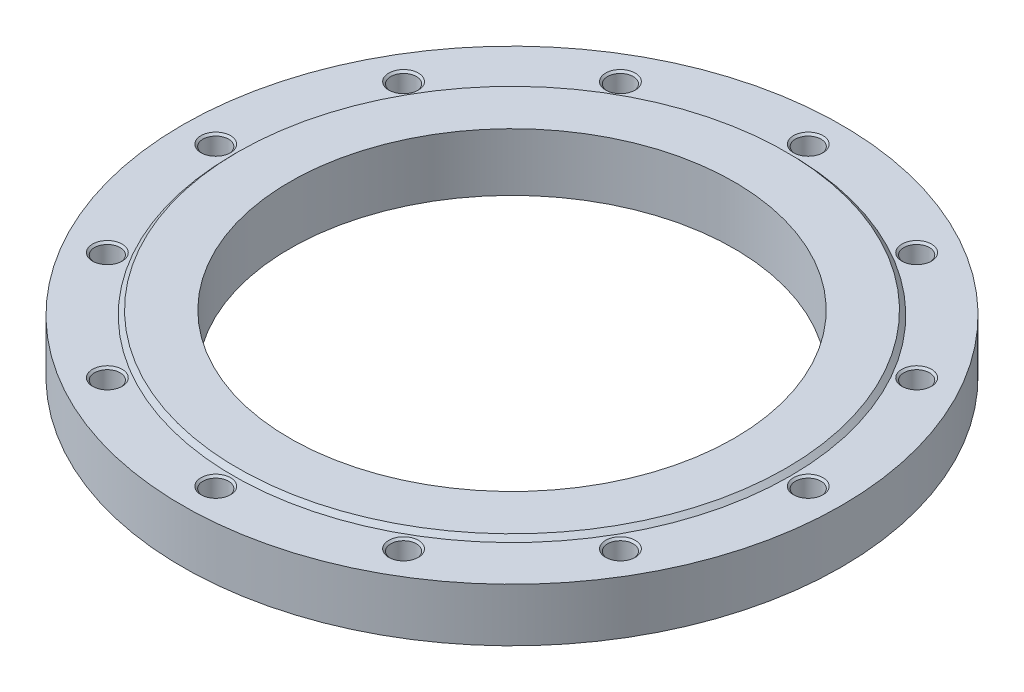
ISO-10303-21;
HEADER;
FILE_DESCRIPTION(('STEP AP214'),'2;1');
FILE_NAME('part.step','',(''),(''),'','','');
FILE_SCHEMA(('AUTOMOTIVE_DESIGN { 1 0 10303 214 1 1 1 1 }'));
ENDSEC;
DATA;
#1=APPLICATION_CONTEXT('core data for automotive mechanical design processes');
#2=APPLICATION_PROTOCOL_DEFINITION('international standard','automotive_design',2000,#1);
#3=PRODUCT_CONTEXT('',#1,'mechanical');
#4=PRODUCT('Part','Part','',(#3));
#5=PRODUCT_RELATED_PRODUCT_CATEGORY('part','',(#4));
#6=PRODUCT_DEFINITION_FORMATION('','',#4);
#7=PRODUCT_DEFINITION_CONTEXT('part definition',#1,'design');
#8=PRODUCT_DEFINITION('design','',#6,#7);
#9=PRODUCT_DEFINITION_SHAPE('','',#8);
#10=(LENGTH_UNIT() NAMED_UNIT(*) SI_UNIT(.MILLI.,.METRE.));
#11=(NAMED_UNIT(*) PLANE_ANGLE_UNIT() SI_UNIT($,.RADIAN.));
#12=(NAMED_UNIT(*) SI_UNIT($,.STERADIAN.) SOLID_ANGLE_UNIT());
#13=UNCERTAINTY_MEASURE_WITH_UNIT(LENGTH_MEASURE(1.E-05),#10,'distance_accuracy_value','');
#14=(GEOMETRIC_REPRESENTATION_CONTEXT(3) GLOBAL_UNCERTAINTY_ASSIGNED_CONTEXT((#13)) GLOBAL_UNIT_ASSIGNED_CONTEXT((#10,
#11,#12)) REPRESENTATION_CONTEXT('',''));
#15=CARTESIAN_POINT('',(0.,0.,0.));
#16=DIRECTION('',(0.,0.,1.));
#17=DIRECTION('',(1.,0.,0.));
#18=AXIS2_PLACEMENT_3D('',#15,#16,#17);
#19=CARTESIAN_POINT('',(0.,18.,0.));
#20=DIRECTION('',(0.,-1.,0.));
#21=DIRECTION('',(1.,0.,0.));
#22=AXIS2_PLACEMENT_3D('',#19,#20,#21);
#23=CYLINDRICAL_SURFACE('',#22,222.5);
#24=CARTESIAN_POINT('',(0.,0.,0.));
#25=DIRECTION('',(0.,1.,0.));
#26=DIRECTION('',(1.,0.,0.));
#27=AXIS2_PLACEMENT_3D('',#24,#25,#26);
#28=CIRCLE('',#27,222.5);
#29=CARTESIAN_POINT('',(222.5,0.,0.));
#30=VERTEX_POINT('',#29);
#31=EDGE_CURVE('E9',#30,#30,#28,.T.);
#32=ORIENTED_EDGE('',*,*,#31,.T.);
#33=EDGE_LOOP('',(#32));
#34=FACE_BOUND('',#33,.T.);
#35=CARTESIAN_POINT('',(0.,36.,0.));
#36=DIRECTION('',(0.,1.,0.));
#37=DIRECTION('',(1.,0.,0.));
#38=AXIS2_PLACEMENT_3D('',#35,#36,#37);
#39=CIRCLE('',#38,222.5);
#40=CARTESIAN_POINT('',(222.5,36.,0.));
#41=VERTEX_POINT('',#40);
#42=EDGE_CURVE('E325',#41,#41,#39,.T.);
#43=ORIENTED_EDGE('',*,*,#42,.F.);
#44=EDGE_LOOP('',(#43));
#45=FACE_BOUND('',#44,.T.);
#46=ADVANCED_FACE('F15',(#34,#45),#23,.T.);
#47=CARTESIAN_POINT('',(186.25,0.,0.));
#48=DIRECTION('',(0.,-1.,0.));
#49=DIRECTION('',(-1.,0.,0.));
#50=AXIS2_PLACEMENT_3D('',#47,#48,#49);
#51=PLANE('',#50);
#52=CARTESIAN_POINT('',(0.,0.,0.));
#53=DIRECTION('',(0.,1.,0.));
#54=DIRECTION('',(1.,0.,0.));
#55=AXIS2_PLACEMENT_3D('',#52,#53,#54);
#56=CIRCLE('',#55,150.);
#57=CARTESIAN_POINT('',(150.,0.,0.));
#58=VERTEX_POINT('',#57);
#59=EDGE_CURVE('E22',#58,#58,#56,.T.);
#60=ORIENTED_EDGE('',*,*,#59,.T.);
#61=EDGE_LOOP('',(#60));
#62=FACE_BOUND('',#61,.T.);
#63=ORIENTED_EDGE('',*,*,#31,.F.);
#64=EDGE_LOOP('',(#63));
#65=FACE_BOUND('',#64,.T.);
#66=ADVANCED_FACE('F374',(#62,#65),#51,.T.);
#67=CARTESIAN_POINT('',(0.,19.5,0.));
#68=DIRECTION('',(0.,-1.,0.));
#69=DIRECTION('',(1.,0.,0.));
#70=AXIS2_PLACEMENT_3D('',#67,#68,#69);
#71=CYLINDRICAL_SURFACE('',#70,150.);
#72=CARTESIAN_POINT('',(0.,39.,0.));
#73=DIRECTION('',(0.,1.,0.));
#74=DIRECTION('',(1.,0.,0.));
#75=AXIS2_PLACEMENT_3D('',#72,#73,#74);
#76=CIRCLE('',#75,150.);
#77=CARTESIAN_POINT('',(150.,39.,0.));
#78=VERTEX_POINT('',#77);
#79=EDGE_CURVE('E357',#78,#78,#76,.T.);
#80=ORIENTED_EDGE('',*,*,#79,.T.);
#81=EDGE_LOOP('',(#80));
#82=FACE_BOUND('',#81,.T.);
#83=ORIENTED_EDGE('',*,*,#59,.F.);
#84=EDGE_LOOP('',(#83));
#85=FACE_BOUND('',#84,.T.);
#86=ADVANCED_FACE('F360',(#82,#85),#71,.F.);
#87=CARTESIAN_POINT('',(167.5,39.,0.));
#88=DIRECTION('',(0.,1.,0.));
#89=DIRECTION('',(1.,0.,0.));
#90=AXIS2_PLACEMENT_3D('',#87,#88,#89);
#91=PLANE('',#90);
#92=CARTESIAN_POINT('',(0.,39.,0.));
#93=DIRECTION('',(0.,1.,0.));
#94=DIRECTION('',(1.,0.,0.));
#95=AXIS2_PLACEMENT_3D('',#92,#93,#94);
#96=CIRCLE('',#95,185.);
#97=CARTESIAN_POINT('',(185.,39.,0.));
#98=VERTEX_POINT('',#97);
#99=EDGE_CURVE('E355',#98,#98,#96,.T.);
#100=ORIENTED_EDGE('',*,*,#99,.T.);
#101=EDGE_LOOP('',(#100));
#102=FACE_BOUND('',#101,.T.);
#103=ORIENTED_EDGE('',*,*,#79,.F.);
#104=EDGE_LOOP('',(#103));
#105=FACE_BOUND('',#104,.T.);
#106=ADVANCED_FACE('F363',(#102,#105),#91,.T.);
#107=CARTESIAN_POINT('',(0.,37.5,0.));
#108=DIRECTION('',(0.,-1.,0.));
#109=DIRECTION('',(1.,0.,0.));
#110=AXIS2_PLACEMENT_3D('',#107,#108,#109);
#111=CONICAL_SURFACE('',#110,186.5,0.785398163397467);
#112=CARTESIAN_POINT('',(0.,36.,0.));
#113=DIRECTION('',(0.,1.,0.));
#114=DIRECTION('',(1.,0.,0.));
#115=AXIS2_PLACEMENT_3D('',#112,#113,#114);
#116=CIRCLE('',#115,188.);
#117=CARTESIAN_POINT('',(188.,36.,0.));
#118=VERTEX_POINT('',#117);
#119=EDGE_CURVE('E198',#118,#118,#116,.T.);
#120=ORIENTED_EDGE('',*,*,#119,.T.);
#121=EDGE_LOOP('',(#120));
#122=FACE_BOUND('',#121,.T.);
#123=ORIENTED_EDGE('',*,*,#99,.F.);
#124=EDGE_LOOP('',(#123));
#125=FACE_BOUND('',#124,.T.);
#126=ADVANCED_FACE('F365',(#122,#125),#111,.T.);
#127=CARTESIAN_POINT('',(205.25,36.,0.));
#128=DIRECTION('',(0.,1.,0.));
#129=DIRECTION('',(1.,0.,0.));
#130=AXIS2_PLACEMENT_3D('',#127,#128,#129);
#131=PLANE('',#130);
#132=ORIENTED_EDGE('',*,*,#42,.T.);
#133=EDGE_LOOP('',(#132));
#134=FACE_BOUND('',#133,.T.);
#135=ORIENTED_EDGE('',*,*,#119,.F.);
#136=EDGE_LOOP('',(#135));
#137=FACE_BOUND('',#136,.T.);
#138=CARTESIAN_POINT('',(200.,36.,0.));
#139=DIRECTION('',(0.,-1.,0.));
#140=DIRECTION('',(1.,0.,0.));
#141=AXIS2_PLACEMENT_3D('',#138,#139,#140);
#142=CIRCLE('',#141,10.);
#143=CARTESIAN_POINT('',(210.,36.,0.));
#144=VERTEX_POINT('',#143);
#145=EDGE_CURVE('E345',#144,#144,#142,.T.);
#146=ORIENTED_EDGE('',*,*,#145,.T.);
#147=EDGE_LOOP('',(#146));
#148=FACE_BOUND('',#147,.T.);
#149=CARTESIAN_POINT('',(173.205080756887,36.,-100.));
#150=DIRECTION('',(0.,-1.,0.));
#151=DIRECTION('',(0.866025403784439,0.,-0.5));
#152=AXIS2_PLACEMENT_3D('',#149,#150,#151);
#153=CIRCLE('',#152,10.);
#154=CARTESIAN_POINT('',(181.865334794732,36.,-105.));
#155=VERTEX_POINT('',#154);
#156=EDGE_CURVE('E333',#155,#155,#153,.T.);
#157=ORIENTED_EDGE('',*,*,#156,.T.);
#158=EDGE_LOOP('',(#157));
#159=FACE_BOUND('',#158,.T.);
#160=CARTESIAN_POINT('',(100.,36.,-173.205080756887));
#161=DIRECTION('',(0.,-1.,0.));
#162=DIRECTION('',(0.5,0.,-0.866025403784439));
#163=AXIS2_PLACEMENT_3D('',#160,#161,#162);
#164=CIRCLE('',#163,10.);
#165=CARTESIAN_POINT('',(105.,36.,-181.865334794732));
#166=VERTEX_POINT('',#165);
#167=EDGE_CURVE('E320',#166,#166,#164,.T.);
#168=ORIENTED_EDGE('',*,*,#167,.T.);
#169=EDGE_LOOP('',(#168));
#170=FACE_BOUND('',#169,.T.);
#171=CARTESIAN_POINT('',(0.,36.,-200.));
#172=DIRECTION('',(0.,-1.,0.));
#173=DIRECTION('',(0.,0.,-1.));
#174=AXIS2_PLACEMENT_3D('',#171,#172,#173);
#175=CIRCLE('',#174,10.);
#176=CARTESIAN_POINT('',(0.,36.,-210.));
#177=VERTEX_POINT('',#176);
#178=EDGE_CURVE('E311',#177,#177,#175,.T.);
#179=ORIENTED_EDGE('',*,*,#178,.T.);
#180=EDGE_LOOP('',(#179));
#181=FACE_BOUND('',#180,.T.);
#182=CARTESIAN_POINT('',(-100.,36.,-173.205080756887));
#183=DIRECTION('',(0.,-1.,0.));
#184=DIRECTION('',(-0.5,0.,-0.866025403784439));
#185=AXIS2_PLACEMENT_3D('',#182,#183,#184);
#186=CIRCLE('',#185,10.);
#187=CARTESIAN_POINT('',(-105.,36.,-181.865334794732));
#188=VERTEX_POINT('',#187);
#189=EDGE_CURVE('E292',#188,#188,#186,.T.);
#190=ORIENTED_EDGE('',*,*,#189,.T.);
#191=EDGE_LOOP('',(#190));
#192=FACE_BOUND('',#191,.T.);
#193=CARTESIAN_POINT('',(-173.205080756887,36.,-100.));
#194=DIRECTION('',(0.,-1.,0.));
#195=DIRECTION('',(-0.866025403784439,0.,-0.5));
#196=AXIS2_PLACEMENT_3D('',#193,#194,#195);
#197=CIRCLE('',#196,10.);
#198=CARTESIAN_POINT('',(-181.865334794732,36.,-105.));
#199=VERTEX_POINT('',#198);
#200=EDGE_CURVE('E479',#199,#199,#197,.T.);
#201=ORIENTED_EDGE('',*,*,#200,.T.);
#202=EDGE_LOOP('',(#201));
#203=FACE_BOUND('',#202,.T.);
#204=CARTESIAN_POINT('',(-200.,36.,0.));
#205=DIRECTION('',(0.,-1.,0.));
#206=DIRECTION('',(-1.,0.,0.));
#207=AXIS2_PLACEMENT_3D('',#204,#205,#206);
#208=CIRCLE('',#207,10.);
#209=CARTESIAN_POINT('',(-210.,36.,0.));
#210=VERTEX_POINT('',#209);
#211=EDGE_CURVE('E467',#210,#210,#208,.T.);
#212=ORIENTED_EDGE('',*,*,#211,.T.);
#213=EDGE_LOOP('',(#212));
#214=FACE_BOUND('',#213,.T.);
#215=CARTESIAN_POINT('',(-173.205080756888,36.,100.));
#216=DIRECTION('',(0.,-1.,0.));
#217=DIRECTION('',(-0.866025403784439,0.,0.5));
#218=AXIS2_PLACEMENT_3D('',#215,#216,#217);
#219=CIRCLE('',#218,10.);
#220=CARTESIAN_POINT('',(-181.865334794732,36.,105.));
#221=VERTEX_POINT('',#220);
#222=EDGE_CURVE('E452',#221,#221,#219,.T.);
#223=ORIENTED_EDGE('',*,*,#222,.T.);
#224=EDGE_LOOP('',(#223));
#225=FACE_BOUND('',#224,.T.);
#226=CARTESIAN_POINT('',(-100.,36.,173.205080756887));
#227=DIRECTION('',(0.,-1.,0.));
#228=DIRECTION('',(-0.5,0.,0.866025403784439));
#229=AXIS2_PLACEMENT_3D('',#226,#227,#228);
#230=CIRCLE('',#229,10.);
#231=CARTESIAN_POINT('',(-105.,36.,181.865334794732));
#232=VERTEX_POINT('',#231);
#233=EDGE_CURVE('E436',#232,#232,#230,.T.);
#234=ORIENTED_EDGE('',*,*,#233,.T.);
#235=EDGE_LOOP('',(#234));
#236=FACE_BOUND('',#235,.T.);
#237=CARTESIAN_POINT('',(0.,36.,200.));
#238=DIRECTION('',(0.,-1.,0.));
#239=DIRECTION('',(0.,0.,1.));
#240=AXIS2_PLACEMENT_3D('',#237,#238,#239);
#241=CIRCLE('',#240,10.);
#242=CARTESIAN_POINT('',(0.,36.,210.));
#243=VERTEX_POINT('',#242);
#244=EDGE_CURVE('E406',#243,#243,#241,.T.);
#245=ORIENTED_EDGE('',*,*,#244,.T.);
#246=EDGE_LOOP('',(#245));
#247=FACE_BOUND('',#246,.T.);
#248=CARTESIAN_POINT('',(100.,36.,173.205080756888));
#249=DIRECTION('',(0.,-1.,0.));
#250=DIRECTION('',(0.5,0.,0.866025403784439));
#251=AXIS2_PLACEMENT_3D('',#248,#249,#250);
#252=CIRCLE('',#251,10.);
#253=CARTESIAN_POINT('',(105.,36.,181.865334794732));
#254=VERTEX_POINT('',#253);
#255=EDGE_CURVE('E411',#254,#254,#252,.T.);
#256=ORIENTED_EDGE('',*,*,#255,.T.);
#257=EDGE_LOOP('',(#256));
#258=FACE_BOUND('',#257,.T.);
#259=CARTESIAN_POINT('',(173.205080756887,36.,100.));
#260=DIRECTION('',(0.,-1.,0.));
#261=DIRECTION('',(0.866025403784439,0.,0.5));
#262=AXIS2_PLACEMENT_3D('',#259,#260,#261);
#263=CIRCLE('',#262,10.);
#264=CARTESIAN_POINT('',(181.865334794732,36.,105.));
#265=VERTEX_POINT('',#264);
#266=EDGE_CURVE('E399',#265,#265,#263,.T.);
#267=ORIENTED_EDGE('',*,*,#266,.T.);
#268=EDGE_LOOP('',(#267));
#269=FACE_BOUND('',#268,.T.);
#270=ADVANCED_FACE('F293',(#134,#137,#148,#159,#170,#181,#192,#203,#214,#225,#236,#247,#258,
#269),#131,.T.);
#271=CARTESIAN_POINT('',(200.,5.50386219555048,0.));
#272=DIRECTION('',(0.,1.,0.));
#273=DIRECTION('',(1.,0.,0.));
#274=AXIS2_PLACEMENT_3D('',#271,#272,#273);
#275=CONICAL_SURFACE('',#274,4.3234375,1.0471975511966);
#276=CARTESIAN_POINT('',(200.,8.,0.));
#277=DIRECTION('',(0.,-1.,0.));
#278=DIRECTION('',(1.,0.,0.));
#279=AXIS2_PLACEMENT_3D('',#276,#277,#278);
#280=CIRCLE('',#279,8.646875);
#281=CARTESIAN_POINT('',(208.646875,8.,0.));
#282=VERTEX_POINT('',#281);
#283=EDGE_CURVE('E203',#282,#282,#280,.T.);
#284=ORIENTED_EDGE('',*,*,#283,.F.);
#285=EDGE_LOOP('',(#284));
#286=FACE_BOUND('',#285,.T.);
#287=CARTESIAN_POINT('',(200.,3.00772439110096,0.));
#288=VERTEX_POINT('',#287);
#289=VERTEX_LOOP('',#288);
#290=FACE_BOUND('',#289,.T.);
#291=ADVANCED_FACE('F385',(#286,#290),#275,.F.);
#292=CARTESIAN_POINT('',(200.,11.3234375,0.));
#293=DIRECTION('',(0.,1.,0.));
#294=DIRECTION('',(1.,0.,0.));
#295=AXIS2_PLACEMENT_3D('',#292,#293,#294);
#296=CYLINDRICAL_SURFACE('',#295,8.646875);
#297=CARTESIAN_POINT('',(200.,14.646875,0.));
#298=DIRECTION('',(0.,-1.,0.));
#299=DIRECTION('',(1.,0.,0.));
#300=AXIS2_PLACEMENT_3D('',#297,#298,#299);
#301=CIRCLE('',#300,8.646875);
#302=CARTESIAN_POINT('',(208.646875,14.646875,0.));
#303=VERTEX_POINT('',#302);
#304=EDGE_CURVE('E351',#303,#303,#301,.T.);
#305=ORIENTED_EDGE('',*,*,#304,.F.);
#306=EDGE_LOOP('',(#305));
#307=FACE_BOUND('',#306,.T.);
#308=ORIENTED_EDGE('',*,*,#283,.T.);
#309=EDGE_LOOP('',(#308));
#310=FACE_BOUND('',#309,.T.);
#311=ADVANCED_FACE('F594',(#307,#310),#296,.F.);
#312=CARTESIAN_POINT('',(200.,15.3234375,0.));
#313=DIRECTION('',(0.,1.,0.));
#314=DIRECTION('',(1.,0.,0.));
#315=AXIS2_PLACEMENT_3D('',#312,#313,#314);
#316=CONICAL_SURFACE('',#315,9.3234375,0.785398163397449);
#317=CARTESIAN_POINT('',(200.,16.,0.));
#318=DIRECTION('',(0.,-1.,0.));
#319=DIRECTION('',(1.,0.,0.));
#320=AXIS2_PLACEMENT_3D('',#317,#318,#319);
#321=CIRCLE('',#320,10.);
#322=CARTESIAN_POINT('',(210.,16.,0.));
#323=VERTEX_POINT('',#322);
#324=EDGE_CURVE('E349',#323,#323,#321,.T.);
#325=ORIENTED_EDGE('',*,*,#324,.F.);
#326=EDGE_LOOP('',(#325));
#327=FACE_BOUND('',#326,.T.);
#328=ORIENTED_EDGE('',*,*,#304,.T.);
#329=EDGE_LOOP('',(#328));
#330=FACE_BOUND('',#329,.T.);
#331=ADVANCED_FACE('F590',(#327,#330),#316,.F.);
#332=CARTESIAN_POINT('',(209.3234375,16.,0.));
#333=DIRECTION('',(0.,1.,0.));
#334=DIRECTION('',(-1.,0.,0.));
#335=AXIS2_PLACEMENT_3D('',#332,#333,#334);
#336=PLANE('',#335);
#337=CARTESIAN_POINT('',(200.,16.,0.));
#338=DIRECTION('',(0.,-1.,0.));
#339=DIRECTION('',(1.,0.,0.));
#340=AXIS2_PLACEMENT_3D('',#337,#338,#339);
#341=CIRCLE('',#340,8.646875);
#342=CARTESIAN_POINT('',(208.646875,16.,0.));
#343=VERTEX_POINT('',#342);
#344=EDGE_CURVE('E347',#343,#343,#341,.T.);
#345=ORIENTED_EDGE('',*,*,#344,.F.);
#346=EDGE_LOOP('',(#345));
#347=FACE_BOUND('',#346,.T.);
#348=ORIENTED_EDGE('',*,*,#324,.T.);
#349=EDGE_LOOP('',(#348));
#350=FACE_BOUND('',#349,.T.);
#351=ADVANCED_FACE('F586',(#347,#350),#336,.F.);
#352=CARTESIAN_POINT('',(200.,25.3234375,0.));
#353=DIRECTION('',(0.,1.,0.));
#354=DIRECTION('',(1.,0.,0.));
#355=AXIS2_PLACEMENT_3D('',#352,#353,#354);
#356=CYLINDRICAL_SURFACE('',#355,8.646875);
#357=CARTESIAN_POINT('',(200.,34.646875,0.));
#358=DIRECTION('',(0.,-1.,0.));
#359=DIRECTION('',(1.,0.,0.));
#360=AXIS2_PLACEMENT_3D('',#357,#358,#359);
#361=CIRCLE('',#360,8.646875);
#362=CARTESIAN_POINT('',(208.646875,34.646875,0.));
#363=VERTEX_POINT('',#362);
#364=EDGE_CURVE('E343',#363,#363,#361,.T.);
#365=ORIENTED_EDGE('',*,*,#364,.F.);
#366=EDGE_LOOP('',(#365));
#367=FACE_BOUND('',#366,.T.);
#368=ORIENTED_EDGE('',*,*,#344,.T.);
#369=EDGE_LOOP('',(#368));
#370=FACE_BOUND('',#369,.T.);
#371=ADVANCED_FACE('F582',(#367,#370),#356,.F.);
#372=CARTESIAN_POINT('',(200.,35.3234375,0.));
#373=DIRECTION('',(0.,1.,0.));
#374=DIRECTION('',(1.,0.,0.));
#375=AXIS2_PLACEMENT_3D('',#372,#373,#374);
#376=CONICAL_SURFACE('',#375,9.3234375,0.785398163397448);
#377=ORIENTED_EDGE('',*,*,#145,.F.);
#378=EDGE_LOOP('',(#377));
#379=FACE_BOUND('',#378,.T.);
#380=ORIENTED_EDGE('',*,*,#364,.T.);
#381=EDGE_LOOP('',(#380));
#382=FACE_BOUND('',#381,.T.);
#383=ADVANCED_FACE('F579',(#379,#382),#376,.F.);
#384=CARTESIAN_POINT('',(173.205080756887,5.50386219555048,-100.));
#385=DIRECTION('',(0.,1.,0.));
#386=DIRECTION('',(0.866025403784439,0.,-0.5));
#387=AXIS2_PLACEMENT_3D('',#384,#385,#386);
#388=CONICAL_SURFACE('',#387,4.3234375,1.0471975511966);
#389=CARTESIAN_POINT('',(173.205080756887,8.,-100.));
#390=DIRECTION('',(0.,-1.,0.));
#391=DIRECTION('',(0.866025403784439,0.,-0.5));
#392=AXIS2_PLACEMENT_3D('',#389,#390,#391);
#393=CIRCLE('',#392,8.646875);
#394=CARTESIAN_POINT('',(180.693494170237,8.,-104.3234375));
#395=VERTEX_POINT('',#394);
#396=EDGE_CURVE('E341',#395,#395,#393,.T.);
#397=ORIENTED_EDGE('',*,*,#396,.F.);
#398=EDGE_LOOP('',(#397));
#399=FACE_BOUND('',#398,.T.);
#400=CARTESIAN_POINT('',(173.205080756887,3.00772439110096,-100.));
#401=VERTEX_POINT('',#400);
#402=VERTEX_LOOP('',#401);
#403=FACE_BOUND('',#402,.T.);
#404=ADVANCED_FACE('F577',(#399,#403),#388,.F.);
#405=CARTESIAN_POINT('',(173.205080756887,11.3234375,-100.));
#406=DIRECTION('',(0.,1.,0.));
#407=DIRECTION('',(0.866025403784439,0.,-0.5));
#408=AXIS2_PLACEMENT_3D('',#405,#406,#407);
#409=CYLINDRICAL_SURFACE('',#408,8.646875);
#410=CARTESIAN_POINT('',(173.205080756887,14.646875,-100.));
#411=DIRECTION('',(0.,-1.,0.));
#412=DIRECTION('',(0.866025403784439,0.,-0.5));
#413=AXIS2_PLACEMENT_3D('',#410,#411,#412);
#414=CIRCLE('',#413,8.646875);
#415=CARTESIAN_POINT('',(180.693494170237,14.646875,-104.3234375));
#416=VERTEX_POINT('',#415);
#417=EDGE_CURVE('E339',#416,#416,#414,.T.);
#418=ORIENTED_EDGE('',*,*,#417,.F.);
#419=EDGE_LOOP('',(#418));
#420=FACE_BOUND('',#419,.T.);
#421=ORIENTED_EDGE('',*,*,#396,.T.);
#422=EDGE_LOOP('',(#421));
#423=FACE_BOUND('',#422,.T.);
#424=ADVANCED_FACE('F573',(#420,#423),#409,.F.);
#425=CARTESIAN_POINT('',(173.205080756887,15.3234375,-100.));
#426=DIRECTION('',(0.,1.,0.));
#427=DIRECTION('',(0.866025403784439,0.,-0.5));
#428=AXIS2_PLACEMENT_3D('',#425,#426,#427);
#429=CONICAL_SURFACE('',#428,9.3234375,0.785398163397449);
#430=CARTESIAN_POINT('',(173.205080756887,16.,-100.));
#431=DIRECTION('',(0.,-1.,0.));
#432=DIRECTION('',(0.866025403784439,0.,-0.5));
#433=AXIS2_PLACEMENT_3D('',#430,#431,#432);
#434=CIRCLE('',#433,10.);
#435=CARTESIAN_POINT('',(181.865334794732,16.,-105.));
#436=VERTEX_POINT('',#435);
#437=EDGE_CURVE('E337',#436,#436,#434,.T.);
#438=ORIENTED_EDGE('',*,*,#437,.F.);
#439=EDGE_LOOP('',(#438));
#440=FACE_BOUND('',#439,.T.);
#441=ORIENTED_EDGE('',*,*,#417,.T.);
#442=EDGE_LOOP('',(#441));
#443=FACE_BOUND('',#442,.T.);
#444=ADVANCED_FACE('F569',(#440,#443),#429,.F.);
#445=CARTESIAN_POINT('',(181.279414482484,16.,-104.66171875));
#446=DIRECTION('',(0.,1.,0.));
#447=DIRECTION('',(-0.866025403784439,0.,0.5));
#448=AXIS2_PLACEMENT_3D('',#445,#446,#447);
#449=PLANE('',#448);
#450=CARTESIAN_POINT('',(173.205080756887,16.,-100.));
#451=DIRECTION('',(0.,-1.,0.));
#452=DIRECTION('',(0.866025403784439,0.,-0.5));
#453=AXIS2_PLACEMENT_3D('',#450,#451,#452);
#454=CIRCLE('',#453,8.646875);
#455=CARTESIAN_POINT('',(180.693494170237,16.,-104.3234375));
#456=VERTEX_POINT('',#455);
#457=EDGE_CURVE('E335',#456,#456,#454,.T.);
#458=ORIENTED_EDGE('',*,*,#457,.F.);
#459=EDGE_LOOP('',(#458));
#460=FACE_BOUND('',#459,.T.);
#461=ORIENTED_EDGE('',*,*,#437,.T.);
#462=EDGE_LOOP('',(#461));
#463=FACE_BOUND('',#462,.T.);
#464=ADVANCED_FACE('F565',(#460,#463),#449,.F.);
#465=CARTESIAN_POINT('',(173.205080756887,25.3234375,-100.));
#466=DIRECTION('',(0.,1.,0.));
#467=DIRECTION('',(0.866025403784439,0.,-0.5));
#468=AXIS2_PLACEMENT_3D('',#465,#466,#467);
#469=CYLINDRICAL_SURFACE('',#468,8.646875);
#470=CARTESIAN_POINT('',(173.205080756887,34.646875,-100.));
#471=DIRECTION('',(0.,-1.,0.));
#472=DIRECTION('',(0.866025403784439,0.,-0.5));
#473=AXIS2_PLACEMENT_3D('',#470,#471,#472);
#474=CIRCLE('',#473,8.646875);
#475=CARTESIAN_POINT('',(180.693494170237,34.646875,-104.3234375));
#476=VERTEX_POINT('',#475);
#477=EDGE_CURVE('E331',#476,#476,#474,.T.);
#478=ORIENTED_EDGE('',*,*,#477,.F.);
#479=EDGE_LOOP('',(#478));
#480=FACE_BOUND('',#479,.T.);
#481=ORIENTED_EDGE('',*,*,#457,.T.);
#482=EDGE_LOOP('',(#481));
#483=FACE_BOUND('',#482,.T.);
#484=ADVANCED_FACE('F562',(#480,#483),#469,.F.);
#485=CARTESIAN_POINT('',(173.205080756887,35.3234375,-100.));
#486=DIRECTION('',(0.,1.,0.));
#487=DIRECTION('',(0.866025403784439,0.,-0.5));
#488=AXIS2_PLACEMENT_3D('',#485,#486,#487);
#489=CONICAL_SURFACE('',#488,9.3234375,0.785398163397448);
#490=ORIENTED_EDGE('',*,*,#156,.F.);
#491=EDGE_LOOP('',(#490));
#492=FACE_BOUND('',#491,.T.);
#493=ORIENTED_EDGE('',*,*,#477,.T.);
#494=EDGE_LOOP('',(#493));
#495=FACE_BOUND('',#494,.T.);
#496=ADVANCED_FACE('F560',(#492,#495),#489,.F.);
#497=CARTESIAN_POINT('',(100.,5.50386219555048,-173.205080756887));
#498=DIRECTION('',(0.,1.,0.));
#499=DIRECTION('',(0.5,0.,-0.866025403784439));
#500=AXIS2_PLACEMENT_3D('',#497,#498,#499);
#501=CONICAL_SURFACE('',#500,4.3234375,1.0471975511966);
#502=CARTESIAN_POINT('',(100.,8.,-173.205080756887));
#503=DIRECTION('',(0.,-1.,0.));
#504=DIRECTION('',(0.5,0.,-0.866025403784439));
#505=AXIS2_PLACEMENT_3D('',#502,#503,#504);
#506=CIRCLE('',#505,8.646875);
#507=CARTESIAN_POINT('',(104.3234375,8.,-180.693494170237));
#508=VERTEX_POINT('',#507);
#509=EDGE_CURVE('E329',#508,#508,#506,.T.);
#510=ORIENTED_EDGE('',*,*,#509,.F.);
#511=EDGE_LOOP('',(#510));
#512=FACE_BOUND('',#511,.T.);
#513=CARTESIAN_POINT('',(100.,3.00772439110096,-173.205080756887));
#514=VERTEX_POINT('',#513);
#515=VERTEX_LOOP('',#514);
#516=FACE_BOUND('',#515,.T.);
#517=ADVANCED_FACE('F556',(#512,#516),#501,.F.);
#518=CARTESIAN_POINT('',(100.,11.3234375,-173.205080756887));
#519=DIRECTION('',(0.,1.,0.));
#520=DIRECTION('',(0.5,0.,-0.866025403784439));
#521=AXIS2_PLACEMENT_3D('',#518,#519,#520);
#522=CYLINDRICAL_SURFACE('',#521,8.646875);
#523=CARTESIAN_POINT('',(100.,14.646875,-173.205080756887));
#524=DIRECTION('',(0.,-1.,0.));
#525=DIRECTION('',(0.5,0.,-0.866025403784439));
#526=AXIS2_PLACEMENT_3D('',#523,#524,#525);
#527=CIRCLE('',#526,8.646875);
#528=CARTESIAN_POINT('',(104.3234375,14.646875,-180.693494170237));
#529=VERTEX_POINT('',#528);
#530=EDGE_CURVE('E327',#529,#529,#527,.T.);
#531=ORIENTED_EDGE('',*,*,#530,.F.);
#532=EDGE_LOOP('',(#531));
#533=FACE_BOUND('',#532,.T.);
#534=ORIENTED_EDGE('',*,*,#509,.T.);
#535=EDGE_LOOP('',(#534));
#536=FACE_BOUND('',#535,.T.);
#537=ADVANCED_FACE('F552',(#533,#536),#522,.F.);
#538=CARTESIAN_POINT('',(100.,15.3234375,-173.205080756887));
#539=DIRECTION('',(0.,1.,0.));
#540=DIRECTION('',(0.5,0.,-0.866025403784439));
#541=AXIS2_PLACEMENT_3D('',#538,#539,#540);
#542=CONICAL_SURFACE('',#541,9.3234375,0.785398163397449);
#543=CARTESIAN_POINT('',(100.,16.,-173.205080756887));
#544=DIRECTION('',(0.,-1.,0.));
#545=DIRECTION('',(0.5,0.,-0.866025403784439));
#546=AXIS2_PLACEMENT_3D('',#543,#544,#545);
#547=CIRCLE('',#546,10.);
#548=CARTESIAN_POINT('',(105.,16.,-181.865334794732));
#549=VERTEX_POINT('',#548);
#550=EDGE_CURVE('E323',#549,#549,#547,.T.);
#551=ORIENTED_EDGE('',*,*,#550,.F.);
#552=EDGE_LOOP('',(#551));
#553=FACE_BOUND('',#552,.T.);
#554=ORIENTED_EDGE('',*,*,#530,.T.);
#555=EDGE_LOOP('',(#554));
#556=FACE_BOUND('',#555,.T.);
#557=ADVANCED_FACE('F548',(#553,#556),#542,.F.);
#558=CARTESIAN_POINT('',(104.66171875,16.,-181.279414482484));
#559=DIRECTION('',(0.,1.,0.));
#560=DIRECTION('',(-0.5,0.,0.866025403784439));
#561=AXIS2_PLACEMENT_3D('',#558,#559,#560);
#562=PLANE('',#561);
#563=CARTESIAN_POINT('',(100.,16.,-173.205080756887));
#564=DIRECTION('',(0.,-1.,0.));
#565=DIRECTION('',(0.5,0.,-0.866025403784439));
#566=AXIS2_PLACEMENT_3D('',#563,#564,#565);
#567=CIRCLE('',#566,8.646875);
#568=CARTESIAN_POINT('',(104.3234375,16.,-180.693494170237));
#569=VERTEX_POINT('',#568);
#570=EDGE_CURVE('E321',#569,#569,#567,.T.);
#571=ORIENTED_EDGE('',*,*,#570,.F.);
#572=EDGE_LOOP('',(#571));
#573=FACE_BOUND('',#572,.T.);
#574=ORIENTED_EDGE('',*,*,#550,.T.);
#575=EDGE_LOOP('',(#574));
#576=FACE_BOUND('',#575,.T.);
#577=ADVANCED_FACE('F544',(#573,#576),#562,.F.);
#578=CARTESIAN_POINT('',(100.,25.3234375,-173.205080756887));
#579=DIRECTION('',(0.,1.,0.));
#580=DIRECTION('',(0.5,0.,-0.866025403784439));
#581=AXIS2_PLACEMENT_3D('',#578,#579,#580);
#582=CYLINDRICAL_SURFACE('',#581,8.646875);
#583=CARTESIAN_POINT('',(100.,34.646875,-173.205080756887));
#584=DIRECTION('',(0.,-1.,0.));
#585=DIRECTION('',(0.5,0.,-0.866025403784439));
#586=AXIS2_PLACEMENT_3D('',#583,#584,#585);
#587=CIRCLE('',#586,8.646875);
#588=CARTESIAN_POINT('',(104.3234375,34.646875,-180.693494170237));
#589=VERTEX_POINT('',#588);
#590=EDGE_CURVE('E318',#589,#589,#587,.T.);
#591=ORIENTED_EDGE('',*,*,#590,.F.);
#592=EDGE_LOOP('',(#591));
#593=FACE_BOUND('',#592,.T.);
#594=ORIENTED_EDGE('',*,*,#570,.T.);
#595=EDGE_LOOP('',(#594));
#596=FACE_BOUND('',#595,.T.);
#597=ADVANCED_FACE('F540',(#593,#596),#582,.F.);
#598=CARTESIAN_POINT('',(100.,35.3234375,-173.205080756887));
#599=DIRECTION('',(0.,1.,0.));
#600=DIRECTION('',(0.5,0.,-0.866025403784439));
#601=AXIS2_PLACEMENT_3D('',#598,#599,#600);
#602=CONICAL_SURFACE('',#601,9.3234375,0.785398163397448);
#603=ORIENTED_EDGE('',*,*,#167,.F.);
#604=EDGE_LOOP('',(#603));
#605=FACE_BOUND('',#604,.T.);
#606=ORIENTED_EDGE('',*,*,#590,.T.);
#607=EDGE_LOOP('',(#606));
#608=FACE_BOUND('',#607,.T.);
#609=ADVANCED_FACE('F537',(#605,#608),#602,.F.);
#610=CARTESIAN_POINT('',(0.,5.50386219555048,-200.));
#611=DIRECTION('',(0.,1.,0.));
#612=DIRECTION('',(0.,0.,-1.));
#613=AXIS2_PLACEMENT_3D('',#610,#611,#612);
#614=CONICAL_SURFACE('',#613,4.3234375,1.0471975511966);
#615=CARTESIAN_POINT('',(0.,8.,-200.));
#616=DIRECTION('',(0.,-1.,0.));
#617=DIRECTION('',(0.,0.,-1.));
#618=AXIS2_PLACEMENT_3D('',#615,#616,#617);
#619=CIRCLE('',#618,8.646875);
#620=CARTESIAN_POINT('',(0.,8.,-208.646875));
#621=VERTEX_POINT('',#620);
#622=EDGE_CURVE('E317',#621,#621,#619,.T.);
#623=ORIENTED_EDGE('',*,*,#622,.F.);
#624=EDGE_LOOP('',(#623));
#625=FACE_BOUND('',#624,.T.);
#626=CARTESIAN_POINT('',(0.,3.00772439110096,-200.));
#627=VERTEX_POINT('',#626);
#628=VERTEX_LOOP('',#627);
#629=FACE_BOUND('',#628,.T.);
#630=ADVANCED_FACE('F535',(#625,#629),#614,.F.);
#631=CARTESIAN_POINT('',(0.,11.3234375,-200.));
#632=DIRECTION('',(0.,1.,0.));
#633=DIRECTION('',(0.,0.,-1.));
#634=AXIS2_PLACEMENT_3D('',#631,#632,#633);
#635=CYLINDRICAL_SURFACE('',#634,8.646875);
#636=CARTESIAN_POINT('',(0.,14.646875,-200.));
#637=DIRECTION('',(0.,-1.,0.));
#638=DIRECTION('',(0.,0.,-1.));
#639=AXIS2_PLACEMENT_3D('',#636,#637,#638);
#640=CIRCLE('',#639,8.646875);
#641=CARTESIAN_POINT('',(0.,14.646875,-208.646875));
#642=VERTEX_POINT('',#641);
#643=EDGE_CURVE('E315',#642,#642,#640,.T.);
#644=ORIENTED_EDGE('',*,*,#643,.F.);
#645=EDGE_LOOP('',(#644));
#646=FACE_BOUND('',#645,.T.);
#647=ORIENTED_EDGE('',*,*,#622,.T.);
#648=EDGE_LOOP('',(#647));
#649=FACE_BOUND('',#648,.T.);
#650=ADVANCED_FACE('F531',(#646,#649),#635,.F.);
#651=CARTESIAN_POINT('',(0.,15.3234375,-200.));
#652=DIRECTION('',(0.,1.,0.));
#653=DIRECTION('',(0.,0.,-1.));
#654=AXIS2_PLACEMENT_3D('',#651,#652,#653);
#655=CONICAL_SURFACE('',#654,9.3234375,0.785398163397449);
#656=CARTESIAN_POINT('',(0.,16.,-200.));
#657=DIRECTION('',(0.,-1.,0.));
#658=DIRECTION('',(0.,0.,-1.));
#659=AXIS2_PLACEMENT_3D('',#656,#657,#658);
#660=CIRCLE('',#659,10.);
#661=CARTESIAN_POINT('',(0.,16.,-210.));
#662=VERTEX_POINT('',#661);
#663=EDGE_CURVE('E314',#662,#662,#660,.T.);
#664=ORIENTED_EDGE('',*,*,#663,.F.);
#665=EDGE_LOOP('',(#664));
#666=FACE_BOUND('',#665,.T.);
#667=ORIENTED_EDGE('',*,*,#643,.T.);
#668=EDGE_LOOP('',(#667));
#669=FACE_BOUND('',#668,.T.);
#670=ADVANCED_FACE('F527',(#666,#669),#655,.F.);
#671=CARTESIAN_POINT('',(0.,16.,-209.3234375));
#672=DIRECTION('',(0.,1.,0.));
#673=DIRECTION('',(0.,0.,1.));
#674=AXIS2_PLACEMENT_3D('',#671,#672,#673);
#675=PLANE('',#674);
#676=CARTESIAN_POINT('',(0.,16.,-200.));
#677=DIRECTION('',(0.,-1.,0.));
#678=DIRECTION('',(0.,0.,-1.));
#679=AXIS2_PLACEMENT_3D('',#676,#677,#678);
#680=CIRCLE('',#679,8.646875);
#681=CARTESIAN_POINT('',(0.,16.,-208.646875));
#682=VERTEX_POINT('',#681);
#683=EDGE_CURVE('E312',#682,#682,#680,.T.);
#684=ORIENTED_EDGE('',*,*,#683,.F.);
#685=EDGE_LOOP('',(#684));
#686=FACE_BOUND('',#685,.T.);
#687=ORIENTED_EDGE('',*,*,#663,.T.);
#688=EDGE_LOOP('',(#687));
#689=FACE_BOUND('',#688,.T.);
#690=ADVANCED_FACE('F523',(#686,#689),#675,.F.);
#691=CARTESIAN_POINT('',(0.,25.3234375,-200.));
#692=DIRECTION('',(0.,1.,0.));
#693=DIRECTION('',(0.,0.,-1.));
#694=AXIS2_PLACEMENT_3D('',#691,#692,#693);
#695=CYLINDRICAL_SURFACE('',#694,8.646875);
#696=CARTESIAN_POINT('',(0.,34.646875,-200.));
#697=DIRECTION('',(0.,-1.,0.));
#698=DIRECTION('',(0.,0.,-1.));
#699=AXIS2_PLACEMENT_3D('',#696,#697,#698);
#700=CIRCLE('',#699,8.646875);
#701=CARTESIAN_POINT('',(0.,34.646875,-208.646875));
#702=VERTEX_POINT('',#701);
#703=EDGE_CURVE('E309',#702,#702,#700,.T.);
#704=ORIENTED_EDGE('',*,*,#703,.F.);
#705=EDGE_LOOP('',(#704));
#706=FACE_BOUND('',#705,.T.);
#707=ORIENTED_EDGE('',*,*,#683,.T.);
#708=EDGE_LOOP('',(#707));
#709=FACE_BOUND('',#708,.T.);
#710=ADVANCED_FACE('F520',(#706,#709),#695,.F.);
#711=CARTESIAN_POINT('',(0.,35.3234375,-200.));
#712=DIRECTION('',(0.,1.,0.));
#713=DIRECTION('',(0.,0.,-1.));
#714=AXIS2_PLACEMENT_3D('',#711,#712,#713);
#715=CONICAL_SURFACE('',#714,9.3234375,0.785398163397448);
#716=ORIENTED_EDGE('',*,*,#178,.F.);
#717=EDGE_LOOP('',(#716));
#718=FACE_BOUND('',#717,.T.);
#719=ORIENTED_EDGE('',*,*,#703,.T.);
#720=EDGE_LOOP('',(#719));
#721=FACE_BOUND('',#720,.T.);
#722=ADVANCED_FACE('F517',(#718,#721),#715,.F.);
#723=CARTESIAN_POINT('',(-100.,5.50386219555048,-173.205080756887));
#724=DIRECTION('',(0.,1.,0.));
#725=DIRECTION('',(-0.5,0.,-0.866025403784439));
#726=AXIS2_PLACEMENT_3D('',#723,#724,#725);
#727=CONICAL_SURFACE('',#726,4.3234375,1.0471975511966);
#728=CARTESIAN_POINT('',(-100.,8.,-173.205080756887));
#729=DIRECTION('',(0.,-1.,0.));
#730=DIRECTION('',(-0.5,0.,-0.866025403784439));
#731=AXIS2_PLACEMENT_3D('',#728,#729,#730);
#732=CIRCLE('',#731,8.646875);
#733=CARTESIAN_POINT('',(-104.3234375,8.,-180.693494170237));
#734=VERTEX_POINT('',#733);
#735=EDGE_CURVE('E307',#734,#734,#732,.T.);
#736=ORIENTED_EDGE('',*,*,#735,.F.);
#737=EDGE_LOOP('',(#736));
#738=FACE_BOUND('',#737,.T.);
#739=CARTESIAN_POINT('',(-100.,3.00772439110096,-173.205080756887));
#740=VERTEX_POINT('',#739);
#741=VERTEX_LOOP('',#740);
#742=FACE_BOUND('',#741,.T.);
#743=ADVANCED_FACE('F515',(#738,#742),#727,.F.);
#744=CARTESIAN_POINT('',(-100.,11.3234375,-173.205080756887));
#745=DIRECTION('',(0.,1.,0.));
#746=DIRECTION('',(-0.5,0.,-0.866025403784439));
#747=AXIS2_PLACEMENT_3D('',#744,#745,#746);
#748=CYLINDRICAL_SURFACE('',#747,8.646875);
#749=CARTESIAN_POINT('',(-100.,14.646875,-173.205080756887));
#750=DIRECTION('',(0.,-1.,0.));
#751=DIRECTION('',(-0.5,0.,-0.866025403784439));
#752=AXIS2_PLACEMENT_3D('',#749,#750,#751);
#753=CIRCLE('',#752,8.646875);
#754=CARTESIAN_POINT('',(-104.3234375,14.646875,-180.693494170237));
#755=VERTEX_POINT('',#754);
#756=EDGE_CURVE('E305',#755,#755,#753,.T.);
#757=ORIENTED_EDGE('',*,*,#756,.F.);
#758=EDGE_LOOP('',(#757));
#759=FACE_BOUND('',#758,.T.);
#760=ORIENTED_EDGE('',*,*,#735,.T.);
#761=EDGE_LOOP('',(#760));
#762=FACE_BOUND('',#761,.T.);
#763=ADVANCED_FACE('F511',(#759,#762),#748,.F.);
#764=CARTESIAN_POINT('',(-100.,15.3234375,-173.205080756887));
#765=DIRECTION('',(0.,1.,0.));
#766=DIRECTION('',(-0.5,0.,-0.866025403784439));
#767=AXIS2_PLACEMENT_3D('',#764,#765,#766);
#768=CONICAL_SURFACE('',#767,9.3234375,0.785398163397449);
#769=CARTESIAN_POINT('',(-100.,16.,-173.205080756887));
#770=DIRECTION('',(0.,-1.,0.));
#771=DIRECTION('',(-0.5,0.,-0.866025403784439));
#772=AXIS2_PLACEMENT_3D('',#769,#770,#771);
#773=CIRCLE('',#772,10.);
#774=CARTESIAN_POINT('',(-105.,16.,-181.865334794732));
#775=VERTEX_POINT('',#774);
#776=EDGE_CURVE('E299',#775,#775,#773,.T.);
#777=ORIENTED_EDGE('',*,*,#776,.F.);
#778=EDGE_LOOP('',(#777));
#779=FACE_BOUND('',#778,.T.);
#780=ORIENTED_EDGE('',*,*,#756,.T.);
#781=EDGE_LOOP('',(#780));
#782=FACE_BOUND('',#781,.T.);
#783=ADVANCED_FACE('F508',(#779,#782),#768,.F.);
#784=CARTESIAN_POINT('',(-104.66171875,16.,-181.279414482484));
#785=DIRECTION('',(0.,1.,0.));
#786=DIRECTION('',(0.5,0.,0.866025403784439));
#787=AXIS2_PLACEMENT_3D('',#784,#785,#786);
#788=PLANE('',#787);
#789=CARTESIAN_POINT('',(-100.,16.,-173.205080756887));
#790=DIRECTION('',(0.,-1.,0.));
#791=DIRECTION('',(-0.5,0.,-0.866025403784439));
#792=AXIS2_PLACEMENT_3D('',#789,#790,#791);
#793=CIRCLE('',#792,8.646875);
#794=CARTESIAN_POINT('',(-104.3234375,16.,-180.693494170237));
#795=VERTEX_POINT('',#794);
#796=EDGE_CURVE('E296',#795,#795,#793,.T.);
#797=ORIENTED_EDGE('',*,*,#796,.F.);
#798=EDGE_LOOP('',(#797));
#799=FACE_BOUND('',#798,.T.);
#800=ORIENTED_EDGE('',*,*,#776,.T.);
#801=EDGE_LOOP('',(#800));
#802=FACE_BOUND('',#801,.T.);
#803=ADVANCED_FACE('F506',(#799,#802),#788,.F.);
#804=CARTESIAN_POINT('',(-100.,25.3234375,-173.205080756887));
#805=DIRECTION('',(0.,1.,0.));
#806=DIRECTION('',(-0.5,0.,-0.866025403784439));
#807=AXIS2_PLACEMENT_3D('',#804,#805,#806);
#808=CYLINDRICAL_SURFACE('',#807,8.646875);
#809=CARTESIAN_POINT('',(-100.,34.646875,-173.205080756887));
#810=DIRECTION('',(0.,-1.,0.));
#811=DIRECTION('',(-0.5,0.,-0.866025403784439));
#812=AXIS2_PLACEMENT_3D('',#809,#810,#811);
#813=CIRCLE('',#812,8.646875);
#814=CARTESIAN_POINT('',(-104.3234375,34.646875,-180.693494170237));
#815=VERTEX_POINT('',#814);
#816=EDGE_CURVE('E297',#815,#815,#813,.T.);
#817=ORIENTED_EDGE('',*,*,#816,.F.);
#818=EDGE_LOOP('',(#817));
#819=FACE_BOUND('',#818,.T.);
#820=ORIENTED_EDGE('',*,*,#796,.T.);
#821=EDGE_LOOP('',(#820));
#822=FACE_BOUND('',#821,.T.);
#823=ADVANCED_FACE('F499',(#819,#822),#808,.F.);
#824=CARTESIAN_POINT('',(-100.,35.3234375,-173.205080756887));
#825=DIRECTION('',(0.,1.,0.));
#826=DIRECTION('',(-0.5,0.,-0.866025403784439));
#827=AXIS2_PLACEMENT_3D('',#824,#825,#826);
#828=CONICAL_SURFACE('',#827,9.3234375,0.785398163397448);
#829=ORIENTED_EDGE('',*,*,#189,.F.);
#830=EDGE_LOOP('',(#829));
#831=FACE_BOUND('',#830,.T.);
#832=ORIENTED_EDGE('',*,*,#816,.T.);
#833=EDGE_LOOP('',(#832));
#834=FACE_BOUND('',#833,.T.);
#835=ADVANCED_FACE('F490',(#831,#834),#828,.F.);
#836=CARTESIAN_POINT('',(-173.205080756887,5.50386219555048,-100.));
#837=DIRECTION('',(0.,1.,0.));
#838=DIRECTION('',(-0.866025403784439,0.,-0.5));
#839=AXIS2_PLACEMENT_3D('',#836,#837,#838);
#840=CONICAL_SURFACE('',#839,4.3234375,1.0471975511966);
#841=CARTESIAN_POINT('',(-173.205080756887,8.,-100.));
#842=DIRECTION('',(0.,-1.,0.));
#843=DIRECTION('',(-0.866025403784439,0.,-0.5));
#844=AXIS2_PLACEMENT_3D('',#841,#842,#843);
#845=CIRCLE('',#844,8.646875);
#846=CARTESIAN_POINT('',(-180.693494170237,8.,-104.3234375));
#847=VERTEX_POINT('',#846);
#848=EDGE_CURVE('E301',#847,#847,#845,.T.);
#849=ORIENTED_EDGE('',*,*,#848,.F.);
#850=EDGE_LOOP('',(#849));
#851=FACE_BOUND('',#850,.T.);
#852=CARTESIAN_POINT('',(-173.205080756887,3.00772439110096,-100.));
#853=VERTEX_POINT('',#852);
#854=VERTEX_LOOP('',#853);
#855=FACE_BOUND('',#854,.T.);
#856=ADVANCED_FACE('F487',(#851,#855),#840,.F.);
#857=CARTESIAN_POINT('',(-173.205080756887,11.3234375,-100.));
#858=DIRECTION('',(0.,1.,0.));
#859=DIRECTION('',(-0.866025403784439,0.,-0.5));
#860=AXIS2_PLACEMENT_3D('',#857,#858,#859);
#861=CYLINDRICAL_SURFACE('',#860,8.646875);
#862=CARTESIAN_POINT('',(-173.205080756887,14.646875,-100.));
#863=DIRECTION('',(0.,-1.,0.));
#864=DIRECTION('',(-0.866025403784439,0.,-0.5));
#865=AXIS2_PLACEMENT_3D('',#862,#863,#864);
#866=CIRCLE('',#865,8.646875);
#867=CARTESIAN_POINT('',(-180.693494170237,14.646875,-104.3234375));
#868=VERTEX_POINT('',#867);
#869=EDGE_CURVE('E443',#868,#868,#866,.T.);
#870=ORIENTED_EDGE('',*,*,#869,.F.);
#871=EDGE_LOOP('',(#870));
#872=FACE_BOUND('',#871,.T.);
#873=ORIENTED_EDGE('',*,*,#848,.T.);
#874=EDGE_LOOP('',(#873));
#875=FACE_BOUND('',#874,.T.);
#876=ADVANCED_FACE('F485',(#872,#875),#861,.F.);
#877=CARTESIAN_POINT('',(-173.205080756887,15.3234375,-100.));
#878=DIRECTION('',(0.,1.,0.));
#879=DIRECTION('',(-0.866025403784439,0.,-0.5));
#880=AXIS2_PLACEMENT_3D('',#877,#878,#879);
#881=CONICAL_SURFACE('',#880,9.3234375,0.785398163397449);
#882=CARTESIAN_POINT('',(-173.205080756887,16.,-100.));
#883=DIRECTION('',(0.,-1.,0.));
#884=DIRECTION('',(-0.866025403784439,0.,-0.5));
#885=AXIS2_PLACEMENT_3D('',#882,#883,#884);
#886=CIRCLE('',#885,10.);
#887=CARTESIAN_POINT('',(-181.865334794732,16.,-105.));
#888=VERTEX_POINT('',#887);
#889=EDGE_CURVE('E441',#888,#888,#886,.T.);
#890=ORIENTED_EDGE('',*,*,#889,.F.);
#891=EDGE_LOOP('',(#890));
#892=FACE_BOUND('',#891,.T.);
#893=ORIENTED_EDGE('',*,*,#869,.T.);
#894=EDGE_LOOP('',(#893));
#895=FACE_BOUND('',#894,.T.);
#896=ADVANCED_FACE('F496',(#892,#895),#881,.F.);
#897=CARTESIAN_POINT('',(-181.279414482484,16.,-104.66171875));
#898=DIRECTION('',(0.,1.,0.));
#899=DIRECTION('',(0.866025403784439,0.,0.5));
#900=AXIS2_PLACEMENT_3D('',#897,#898,#899);
#901=PLANE('',#900);
#902=CARTESIAN_POINT('',(-173.205080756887,16.,-100.));
#903=DIRECTION('',(0.,-1.,0.));
#904=DIRECTION('',(-0.866025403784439,0.,-0.5));
#905=AXIS2_PLACEMENT_3D('',#902,#903,#904);
#906=CIRCLE('',#905,8.646875);
#907=CARTESIAN_POINT('',(-180.693494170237,16.,-104.3234375));
#908=VERTEX_POINT('',#907);
#909=EDGE_CURVE('E444',#908,#908,#906,.T.);
#910=ORIENTED_EDGE('',*,*,#909,.F.);
#911=EDGE_LOOP('',(#910));
#912=FACE_BOUND('',#911,.T.);
#913=ORIENTED_EDGE('',*,*,#889,.T.);
#914=EDGE_LOOP('',(#913));
#915=FACE_BOUND('',#914,.T.);
#916=ADVANCED_FACE('F761',(#912,#915),#901,.F.);
#917=CARTESIAN_POINT('',(-173.205080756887,25.3234375,-100.));
#918=DIRECTION('',(0.,1.,0.));
#919=DIRECTION('',(-0.866025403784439,0.,-0.5));
#920=AXIS2_PLACEMENT_3D('',#917,#918,#919);
#921=CYLINDRICAL_SURFACE('',#920,8.646875);
#922=CARTESIAN_POINT('',(-173.205080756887,34.646875,-100.));
#923=DIRECTION('',(0.,-1.,0.));
#924=DIRECTION('',(-0.866025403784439,0.,-0.5));
#925=AXIS2_PLACEMENT_3D('',#922,#923,#924);
#926=CIRCLE('',#925,8.646875);
#927=CARTESIAN_POINT('',(-180.693494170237,34.646875,-104.3234375));
#928=VERTEX_POINT('',#927);
#929=EDGE_CURVE('E477',#928,#928,#926,.T.);
#930=ORIENTED_EDGE('',*,*,#929,.F.);
#931=EDGE_LOOP('',(#930));
#932=FACE_BOUND('',#931,.T.);
#933=ORIENTED_EDGE('',*,*,#909,.T.);
#934=EDGE_LOOP('',(#933));
#935=FACE_BOUND('',#934,.T.);
#936=ADVANCED_FACE('F770',(#932,#935),#921,.F.);
#937=CARTESIAN_POINT('',(-173.205080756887,35.3234375,-100.));
#938=DIRECTION('',(0.,1.,0.));
#939=DIRECTION('',(-0.866025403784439,0.,-0.5));
#940=AXIS2_PLACEMENT_3D('',#937,#938,#939);
#941=CONICAL_SURFACE('',#940,9.3234375,0.785398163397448);
#942=ORIENTED_EDGE('',*,*,#200,.F.);
#943=EDGE_LOOP('',(#942));
#944=FACE_BOUND('',#943,.T.);
#945=ORIENTED_EDGE('',*,*,#929,.T.);
#946=EDGE_LOOP('',(#945));
#947=FACE_BOUND('',#946,.T.);
#948=ADVANCED_FACE('F779',(#944,#947),#941,.F.);
#949=CARTESIAN_POINT('',(-200.,5.50386219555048,0.));
#950=DIRECTION('',(0.,1.,0.));
#951=DIRECTION('',(-1.,0.,0.));
#952=AXIS2_PLACEMENT_3D('',#949,#950,#951);
#953=CONICAL_SURFACE('',#952,4.3234375,1.0471975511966);
#954=CARTESIAN_POINT('',(-200.,8.,0.));
#955=DIRECTION('',(0.,-1.,0.));
#956=DIRECTION('',(-1.,0.,0.));
#957=AXIS2_PLACEMENT_3D('',#954,#955,#956);
#958=CIRCLE('',#957,8.646875);
#959=CARTESIAN_POINT('',(-208.646875,8.,0.));
#960=VERTEX_POINT('',#959);
#961=EDGE_CURVE('E475',#960,#960,#958,.T.);
#962=ORIENTED_EDGE('',*,*,#961,.F.);
#963=EDGE_LOOP('',(#962));
#964=FACE_BOUND('',#963,.T.);
#965=CARTESIAN_POINT('',(-200.,3.00772439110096,0.));
#966=VERTEX_POINT('',#965);
#967=VERTEX_LOOP('',#966);
#968=FACE_BOUND('',#967,.T.);
#969=ADVANCED_FACE('F789',(#964,#968),#953,.F.);
#970=CARTESIAN_POINT('',(-200.,11.3234375,0.));
#971=DIRECTION('',(0.,1.,0.));
#972=DIRECTION('',(-1.,0.,0.));
#973=AXIS2_PLACEMENT_3D('',#970,#971,#972);
#974=CYLINDRICAL_SURFACE('',#973,8.646875);
#975=CARTESIAN_POINT('',(-200.,14.646875,0.));
#976=DIRECTION('',(0.,-1.,0.));
#977=DIRECTION('',(-1.,0.,0.));
#978=AXIS2_PLACEMENT_3D('',#975,#976,#977);
#979=CIRCLE('',#978,8.646875);
#980=CARTESIAN_POINT('',(-208.646875,14.646875,0.));
#981=VERTEX_POINT('',#980);
#982=EDGE_CURVE('E473',#981,#981,#979,.T.);
#983=ORIENTED_EDGE('',*,*,#982,.F.);
#984=EDGE_LOOP('',(#983));
#985=FACE_BOUND('',#984,.T.);
#986=ORIENTED_EDGE('',*,*,#961,.T.);
#987=EDGE_LOOP('',(#986));
#988=FACE_BOUND('',#987,.T.);
#989=ADVANCED_FACE('F799',(#985,#988),#974,.F.);
#990=CARTESIAN_POINT('',(-200.,15.3234375,0.));
#991=DIRECTION('',(0.,1.,0.));
#992=DIRECTION('',(-1.,0.,0.));
#993=AXIS2_PLACEMENT_3D('',#990,#991,#992);
#994=CONICAL_SURFACE('',#993,9.3234375,0.785398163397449);
#995=CARTESIAN_POINT('',(-200.,16.,0.));
#996=DIRECTION('',(0.,-1.,0.));
#997=DIRECTION('',(-1.,0.,0.));
#998=AXIS2_PLACEMENT_3D('',#995,#996,#997);
#999=CIRCLE('',#998,10.);
#1000=CARTESIAN_POINT('',(-210.,16.,0.));
#1001=VERTEX_POINT('',#1000);
#1002=EDGE_CURVE('E471',#1001,#1001,#999,.T.);
#1003=ORIENTED_EDGE('',*,*,#1002,.F.);
#1004=EDGE_LOOP('',(#1003));
#1005=FACE_BOUND('',#1004,.T.);
#1006=ORIENTED_EDGE('',*,*,#982,.T.);
#1007=EDGE_LOOP('',(#1006));
#1008=FACE_BOUND('',#1007,.T.);
#1009=ADVANCED_FACE('F809',(#1005,#1008),#994,.F.);
#1010=CARTESIAN_POINT('',(-209.3234375,16.,0.));
#1011=DIRECTION('',(0.,1.,0.));
#1012=DIRECTION('',(1.,0.,0.));
#1013=AXIS2_PLACEMENT_3D('',#1010,#1011,#1012);
#1014=PLANE('',#1013);
#1015=CARTESIAN_POINT('',(-200.,16.,0.));
#1016=DIRECTION('',(0.,-1.,0.));
#1017=DIRECTION('',(-1.,0.,0.));
#1018=AXIS2_PLACEMENT_3D('',#1015,#1016,#1017);
#1019=CIRCLE('',#1018,8.646875);
#1020=CARTESIAN_POINT('',(-208.646875,16.,0.));
#1021=VERTEX_POINT('',#1020);
#1022=EDGE_CURVE('E469',#1021,#1021,#1019,.T.);
#1023=ORIENTED_EDGE('',*,*,#1022,.F.);
#1024=EDGE_LOOP('',(#1023));
#1025=FACE_BOUND('',#1024,.T.);
#1026=ORIENTED_EDGE('',*,*,#1002,.T.);
#1027=EDGE_LOOP('',(#1026));
#1028=FACE_BOUND('',#1027,.T.);
#1029=ADVANCED_FACE('F819',(#1025,#1028),#1014,.F.);
#1030=CARTESIAN_POINT('',(-200.,25.3234375,0.));
#1031=DIRECTION('',(0.,1.,0.));
#1032=DIRECTION('',(-1.,0.,0.));
#1033=AXIS2_PLACEMENT_3D('',#1030,#1031,#1032);
#1034=CYLINDRICAL_SURFACE('',#1033,8.646875);
#1035=CARTESIAN_POINT('',(-200.,34.646875,0.));
#1036=DIRECTION('',(0.,-1.,0.));
#1037=DIRECTION('',(-1.,0.,0.));
#1038=AXIS2_PLACEMENT_3D('',#1035,#1036,#1037);
#1039=CIRCLE('',#1038,8.646875);
#1040=CARTESIAN_POINT('',(-208.646875,34.646875,0.));
#1041=VERTEX_POINT('',#1040);
#1042=EDGE_CURVE('E464',#1041,#1041,#1039,.T.);
#1043=ORIENTED_EDGE('',*,*,#1042,.F.);
#1044=EDGE_LOOP('',(#1043));
#1045=FACE_BOUND('',#1044,.T.);
#1046=ORIENTED_EDGE('',*,*,#1022,.T.);
#1047=EDGE_LOOP('',(#1046));
#1048=FACE_BOUND('',#1047,.T.);
#1049=ADVANCED_FACE('F829',(#1045,#1048),#1034,.F.);
#1050=CARTESIAN_POINT('',(-200.,35.3234375,0.));
#1051=DIRECTION('',(0.,1.,0.));
#1052=DIRECTION('',(-1.,0.,0.));
#1053=AXIS2_PLACEMENT_3D('',#1050,#1051,#1052);
#1054=CONICAL_SURFACE('',#1053,9.3234375,0.785398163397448);
#1055=ORIENTED_EDGE('',*,*,#211,.F.);
#1056=EDGE_LOOP('',(#1055));
#1057=FACE_BOUND('',#1056,.T.);
#1058=ORIENTED_EDGE('',*,*,#1042,.T.);
#1059=EDGE_LOOP('',(#1058));
#1060=FACE_BOUND('',#1059,.T.);
#1061=ADVANCED_FACE('F839',(#1057,#1060),#1054,.F.);
#1062=CARTESIAN_POINT('',(-173.205080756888,5.50386219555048,100.));
#1063=DIRECTION('',(0.,1.,0.));
#1064=DIRECTION('',(-0.866025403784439,0.,0.5));
#1065=AXIS2_PLACEMENT_3D('',#1062,#1063,#1064);
#1066=CONICAL_SURFACE('',#1065,4.3234375,1.0471975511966);
#1067=CARTESIAN_POINT('',(-173.205080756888,8.,100.));
#1068=DIRECTION('',(0.,-1.,0.));
#1069=DIRECTION('',(-0.866025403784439,0.,0.5));
#1070=AXIS2_PLACEMENT_3D('',#1067,#1068,#1069);
#1071=CIRCLE('',#1070,8.646875);
#1072=CARTESIAN_POINT('',(-180.693494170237,8.,104.3234375));
#1073=VERTEX_POINT('',#1072);
#1074=EDGE_CURVE('E462',#1073,#1073,#1071,.T.);
#1075=ORIENTED_EDGE('',*,*,#1074,.F.);
#1076=EDGE_LOOP('',(#1075));
#1077=FACE_BOUND('',#1076,.T.);
#1078=CARTESIAN_POINT('',(-173.205080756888,3.00772439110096,100.));
#1079=VERTEX_POINT('',#1078);
#1080=VERTEX_LOOP('',#1079);
#1081=FACE_BOUND('',#1080,.T.);
#1082=ADVANCED_FACE('F849',(#1077,#1081),#1066,.F.);
#1083=CARTESIAN_POINT('',(-173.205080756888,11.3234375,100.));
#1084=DIRECTION('',(0.,1.,0.));
#1085=DIRECTION('',(-0.866025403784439,0.,0.5));
#1086=AXIS2_PLACEMENT_3D('',#1083,#1084,#1085);
#1087=CYLINDRICAL_SURFACE('',#1086,8.646875);
#1088=CARTESIAN_POINT('',(-173.205080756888,14.646875,100.));
#1089=DIRECTION('',(0.,-1.,0.));
#1090=DIRECTION('',(-0.866025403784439,0.,0.5));
#1091=AXIS2_PLACEMENT_3D('',#1088,#1089,#1090);
#1092=CIRCLE('',#1091,8.646875);
#1093=CARTESIAN_POINT('',(-180.693494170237,14.646875,104.3234375));
#1094=VERTEX_POINT('',#1093);
#1095=EDGE_CURVE('E460',#1094,#1094,#1092,.T.);
#1096=ORIENTED_EDGE('',*,*,#1095,.F.);
#1097=EDGE_LOOP('',(#1096));
#1098=FACE_BOUND('',#1097,.T.);
#1099=ORIENTED_EDGE('',*,*,#1074,.T.);
#1100=EDGE_LOOP('',(#1099));
#1101=FACE_BOUND('',#1100,.T.);
#1102=ADVANCED_FACE('F859',(#1098,#1101),#1087,.F.);
#1103=CARTESIAN_POINT('',(-173.205080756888,15.3234375,100.));
#1104=DIRECTION('',(0.,1.,0.));
#1105=DIRECTION('',(-0.866025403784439,0.,0.5));
#1106=AXIS2_PLACEMENT_3D('',#1103,#1104,#1105);
#1107=CONICAL_SURFACE('',#1106,9.3234375,0.785398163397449);
#1108=CARTESIAN_POINT('',(-173.205080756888,16.,100.));
#1109=DIRECTION('',(0.,-1.,0.));
#1110=DIRECTION('',(-0.866025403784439,0.,0.5));
#1111=AXIS2_PLACEMENT_3D('',#1108,#1109,#1110);
#1112=CIRCLE('',#1111,10.);
#1113=CARTESIAN_POINT('',(-181.865334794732,16.,105.));
#1114=VERTEX_POINT('',#1113);
#1115=EDGE_CURVE('E458',#1114,#1114,#1112,.T.);
#1116=ORIENTED_EDGE('',*,*,#1115,.F.);
#1117=EDGE_LOOP('',(#1116));
#1118=FACE_BOUND('',#1117,.T.);
#1119=ORIENTED_EDGE('',*,*,#1095,.T.);
#1120=EDGE_LOOP('',(#1119));
#1121=FACE_BOUND('',#1120,.T.);
#1122=ADVANCED_FACE('F869',(#1118,#1121),#1107,.F.);
#1123=CARTESIAN_POINT('',(-181.279414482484,16.,104.66171875));
#1124=DIRECTION('',(0.,1.,0.));
#1125=DIRECTION('',(0.866025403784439,0.,-0.5));
#1126=AXIS2_PLACEMENT_3D('',#1123,#1124,#1125);
#1127=PLANE('',#1126);
#1128=CARTESIAN_POINT('',(-173.205080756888,16.,100.));
#1129=DIRECTION('',(0.,-1.,0.));
#1130=DIRECTION('',(-0.866025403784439,0.,0.5));
#1131=AXIS2_PLACEMENT_3D('',#1128,#1129,#1130);
#1132=CIRCLE('',#1131,8.646875);
#1133=CARTESIAN_POINT('',(-180.693494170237,16.,104.3234375));
#1134=VERTEX_POINT('',#1133);
#1135=EDGE_CURVE('E456',#1134,#1134,#1132,.T.);
#1136=ORIENTED_EDGE('',*,*,#1135,.F.);
#1137=EDGE_LOOP('',(#1136));
#1138=FACE_BOUND('',#1137,.T.);
#1139=ORIENTED_EDGE('',*,*,#1115,.T.);
#1140=EDGE_LOOP('',(#1139));
#1141=FACE_BOUND('',#1140,.T.);
#1142=ADVANCED_FACE('F879',(#1138,#1141),#1127,.F.);
#1143=CARTESIAN_POINT('',(-173.205080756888,25.3234375,100.));
#1144=DIRECTION('',(0.,1.,0.));
#1145=DIRECTION('',(-0.866025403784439,0.,0.5));
#1146=AXIS2_PLACEMENT_3D('',#1143,#1144,#1145);
#1147=CYLINDRICAL_SURFACE('',#1146,8.646875);
#1148=CARTESIAN_POINT('',(-173.205080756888,34.646875,100.));
#1149=DIRECTION('',(0.,-1.,0.));
#1150=DIRECTION('',(-0.866025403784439,0.,0.5));
#1151=AXIS2_PLACEMENT_3D('',#1148,#1149,#1150);
#1152=CIRCLE('',#1151,8.646875);
#1153=CARTESIAN_POINT('',(-180.693494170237,34.646875,104.3234375));
#1154=VERTEX_POINT('',#1153);
#1155=EDGE_CURVE('E450',#1154,#1154,#1152,.T.);
#1156=ORIENTED_EDGE('',*,*,#1155,.F.);
#1157=EDGE_LOOP('',(#1156));
#1158=FACE_BOUND('',#1157,.T.);
#1159=ORIENTED_EDGE('',*,*,#1135,.T.);
#1160=EDGE_LOOP('',(#1159));
#1161=FACE_BOUND('',#1160,.T.);
#1162=ADVANCED_FACE('F889',(#1158,#1161),#1147,.F.);
#1163=CARTESIAN_POINT('',(-173.205080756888,35.3234375,100.));
#1164=DIRECTION('',(0.,1.,0.));
#1165=DIRECTION('',(-0.866025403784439,0.,0.5));
#1166=AXIS2_PLACEMENT_3D('',#1163,#1164,#1165);
#1167=CONICAL_SURFACE('',#1166,9.3234375,0.785398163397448);
#1168=ORIENTED_EDGE('',*,*,#222,.F.);
#1169=EDGE_LOOP('',(#1168));
#1170=FACE_BOUND('',#1169,.T.);
#1171=ORIENTED_EDGE('',*,*,#1155,.T.);
#1172=EDGE_LOOP('',(#1171));
#1173=FACE_BOUND('',#1172,.T.);
#1174=ADVANCED_FACE('F899',(#1170,#1173),#1167,.F.);
#1175=CARTESIAN_POINT('',(-100.,5.50386219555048,173.205080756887));
#1176=DIRECTION('',(0.,1.,0.));
#1177=DIRECTION('',(-0.5,0.,0.866025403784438));
#1178=AXIS2_PLACEMENT_3D('',#1175,#1176,#1177);
#1179=CONICAL_SURFACE('',#1178,4.3234375,1.0471975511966);
#1180=CARTESIAN_POINT('',(-100.,8.,173.205080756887));
#1181=DIRECTION('',(0.,-1.,0.));
#1182=DIRECTION('',(-0.5,0.,0.866025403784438));
#1183=AXIS2_PLACEMENT_3D('',#1180,#1181,#1182);
#1184=CIRCLE('',#1183,8.646875);
#1185=CARTESIAN_POINT('',(-104.3234375,8.,180.693494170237));
#1186=VERTEX_POINT('',#1185);
#1187=EDGE_CURVE('E448',#1186,#1186,#1184,.T.);
#1188=ORIENTED_EDGE('',*,*,#1187,.F.);
#1189=EDGE_LOOP('',(#1188));
#1190=FACE_BOUND('',#1189,.T.);
#1191=CARTESIAN_POINT('',(-100.,3.00772439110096,173.205080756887));
#1192=VERTEX_POINT('',#1191);
#1193=VERTEX_LOOP('',#1192);
#1194=FACE_BOUND('',#1193,.T.);
#1195=ADVANCED_FACE('F909',(#1190,#1194),#1179,.F.);
#1196=CARTESIAN_POINT('',(-100.,11.3234375,173.205080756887));
#1197=DIRECTION('',(0.,1.,0.));
#1198=DIRECTION('',(-0.5,0.,0.866025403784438));
#1199=AXIS2_PLACEMENT_3D('',#1196,#1197,#1198);
#1200=CYLINDRICAL_SURFACE('',#1199,8.646875);
#1201=CARTESIAN_POINT('',(-100.,14.646875,173.205080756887));
#1202=DIRECTION('',(0.,-1.,0.));
#1203=DIRECTION('',(-0.5,0.,0.866025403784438));
#1204=AXIS2_PLACEMENT_3D('',#1201,#1202,#1203);
#1205=CIRCLE('',#1204,8.646875);
#1206=CARTESIAN_POINT('',(-104.3234375,14.646875,180.693494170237));
#1207=VERTEX_POINT('',#1206);
#1208=EDGE_CURVE('E446',#1207,#1207,#1205,.T.);
#1209=ORIENTED_EDGE('',*,*,#1208,.F.);
#1210=EDGE_LOOP('',(#1209));
#1211=FACE_BOUND('',#1210,.T.);
#1212=ORIENTED_EDGE('',*,*,#1187,.T.);
#1213=EDGE_LOOP('',(#1212));
#1214=FACE_BOUND('',#1213,.T.);
#1215=ADVANCED_FACE('F919',(#1211,#1214),#1200,.F.);
#1216=CARTESIAN_POINT('',(-100.,15.3234375,173.205080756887));
#1217=DIRECTION('',(0.,1.,0.));
#1218=DIRECTION('',(-0.5,0.,0.866025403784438));
#1219=AXIS2_PLACEMENT_3D('',#1216,#1217,#1218);
#1220=CONICAL_SURFACE('',#1219,9.3234375,0.785398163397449);
#1221=CARTESIAN_POINT('',(-100.,16.,173.205080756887));
#1222=DIRECTION('',(0.,-1.,0.));
#1223=DIRECTION('',(-0.5,0.,0.866025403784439));
#1224=AXIS2_PLACEMENT_3D('',#1221,#1222,#1223);
#1225=CIRCLE('',#1224,10.);
#1226=CARTESIAN_POINT('',(-105.,16.,181.865334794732));
#1227=VERTEX_POINT('',#1226);
#1228=EDGE_CURVE('E440',#1227,#1227,#1225,.T.);
#1229=ORIENTED_EDGE('',*,*,#1228,.F.);
#1230=EDGE_LOOP('',(#1229));
#1231=FACE_BOUND('',#1230,.T.);
#1232=ORIENTED_EDGE('',*,*,#1208,.T.);
#1233=EDGE_LOOP('',(#1232));
#1234=FACE_BOUND('',#1233,.T.);
#1235=ADVANCED_FACE('F929',(#1231,#1234),#1220,.F.);
#1236=CARTESIAN_POINT('',(-104.66171875,16.,181.279414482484));
#1237=DIRECTION('',(0.,1.,0.));
#1238=DIRECTION('',(0.5,0.,-0.866025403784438));
#1239=AXIS2_PLACEMENT_3D('',#1236,#1237,#1238);
#1240=PLANE('',#1239);
#1241=CARTESIAN_POINT('',(-100.,16.,173.205080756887));
#1242=DIRECTION('',(0.,-1.,0.));
#1243=DIRECTION('',(-0.5,0.,0.866025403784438));
#1244=AXIS2_PLACEMENT_3D('',#1241,#1242,#1243);
#1245=CIRCLE('',#1244,8.646875);
#1246=CARTESIAN_POINT('',(-104.3234375,16.,180.693494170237));
#1247=VERTEX_POINT('',#1246);
#1248=EDGE_CURVE('E438',#1247,#1247,#1245,.T.);
#1249=ORIENTED_EDGE('',*,*,#1248,.F.);
#1250=EDGE_LOOP('',(#1249));
#1251=FACE_BOUND('',#1250,.T.);
#1252=ORIENTED_EDGE('',*,*,#1228,.T.);
#1253=EDGE_LOOP('',(#1252));
#1254=FACE_BOUND('',#1253,.T.);
#1255=ADVANCED_FACE('F939',(#1251,#1254),#1240,.F.);
#1256=CARTESIAN_POINT('',(-100.,25.3234375,173.205080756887));
#1257=DIRECTION('',(0.,1.,0.));
#1258=DIRECTION('',(-0.5,0.,0.866025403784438));
#1259=AXIS2_PLACEMENT_3D('',#1256,#1257,#1258);
#1260=CYLINDRICAL_SURFACE('',#1259,8.646875);
#1261=CARTESIAN_POINT('',(-100.,34.646875,173.205080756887));
#1262=DIRECTION('',(0.,-1.,0.));
#1263=DIRECTION('',(-0.5,0.,0.866025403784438));
#1264=AXIS2_PLACEMENT_3D('',#1261,#1262,#1263);
#1265=CIRCLE('',#1264,8.646875);
#1266=CARTESIAN_POINT('',(-104.3234375,34.646875,180.693494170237));
#1267=VERTEX_POINT('',#1266);
#1268=EDGE_CURVE('E434',#1267,#1267,#1265,.T.);
#1269=ORIENTED_EDGE('',*,*,#1268,.F.);
#1270=EDGE_LOOP('',(#1269));
#1271=FACE_BOUND('',#1270,.T.);
#1272=ORIENTED_EDGE('',*,*,#1248,.T.);
#1273=EDGE_LOOP('',(#1272));
#1274=FACE_BOUND('',#1273,.T.);
#1275=ADVANCED_FACE('F949',(#1271,#1274),#1260,.F.);
#1276=CARTESIAN_POINT('',(-100.,35.3234375,173.205080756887));
#1277=DIRECTION('',(0.,1.,0.));
#1278=DIRECTION('',(-0.5,0.,0.866025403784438));
#1279=AXIS2_PLACEMENT_3D('',#1276,#1277,#1278);
#1280=CONICAL_SURFACE('',#1279,9.3234375,0.785398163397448);
#1281=ORIENTED_EDGE('',*,*,#233,.F.);
#1282=EDGE_LOOP('',(#1281));
#1283=FACE_BOUND('',#1282,.T.);
#1284=ORIENTED_EDGE('',*,*,#1268,.T.);
#1285=EDGE_LOOP('',(#1284));
#1286=FACE_BOUND('',#1285,.T.);
#1287=ADVANCED_FACE('F959',(#1283,#1286),#1280,.F.);
#1288=CARTESIAN_POINT('',(0.,5.50386219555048,200.));
#1289=DIRECTION('',(0.,1.,0.));
#1290=DIRECTION('',(0.,0.,1.));
#1291=AXIS2_PLACEMENT_3D('',#1288,#1289,#1290);
#1292=CONICAL_SURFACE('',#1291,4.3234375,1.0471975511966);
#1293=CARTESIAN_POINT('',(0.,8.,200.));
#1294=DIRECTION('',(0.,-1.,0.));
#1295=DIRECTION('',(0.,0.,1.));
#1296=AXIS2_PLACEMENT_3D('',#1293,#1294,#1295);
#1297=CIRCLE('',#1296,8.646875);
#1298=CARTESIAN_POINT('',(0.,8.,208.646875));
#1299=VERTEX_POINT('',#1298);
#1300=EDGE_CURVE('E432',#1299,#1299,#1297,.T.);
#1301=ORIENTED_EDGE('',*,*,#1300,.F.);
#1302=EDGE_LOOP('',(#1301));
#1303=FACE_BOUND('',#1302,.T.);
#1304=CARTESIAN_POINT('',(0.,3.00772439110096,200.));
#1305=VERTEX_POINT('',#1304);
#1306=VERTEX_LOOP('',#1305);
#1307=FACE_BOUND('',#1306,.T.);
#1308=ADVANCED_FACE('F969',(#1303,#1307),#1292,.F.);
#1309=CARTESIAN_POINT('',(0.,11.3234375,200.));
#1310=DIRECTION('',(0.,1.,0.));
#1311=DIRECTION('',(0.,0.,1.));
#1312=AXIS2_PLACEMENT_3D('',#1309,#1310,#1311);
#1313=CYLINDRICAL_SURFACE('',#1312,8.646875);
#1314=CARTESIAN_POINT('',(0.,14.646875,200.));
#1315=DIRECTION('',(0.,-1.,0.));
#1316=DIRECTION('',(0.,0.,1.));
#1317=AXIS2_PLACEMENT_3D('',#1314,#1315,#1316);
#1318=CIRCLE('',#1317,8.646875);
#1319=CARTESIAN_POINT('',(0.,14.646875,208.646875));
#1320=VERTEX_POINT('',#1319);
#1321=EDGE_CURVE('E430',#1320,#1320,#1318,.T.);
#1322=ORIENTED_EDGE('',*,*,#1321,.F.);
#1323=EDGE_LOOP('',(#1322));
#1324=FACE_BOUND('',#1323,.T.);
#1325=ORIENTED_EDGE('',*,*,#1300,.T.);
#1326=EDGE_LOOP('',(#1325));
#1327=FACE_BOUND('',#1326,.T.);
#1328=ADVANCED_FACE('F979',(#1324,#1327),#1313,.F.);
#1329=CARTESIAN_POINT('',(0.,15.3234375,200.));
#1330=DIRECTION('',(0.,1.,0.));
#1331=DIRECTION('',(0.,0.,1.));
#1332=AXIS2_PLACEMENT_3D('',#1329,#1330,#1331);
#1333=CONICAL_SURFACE('',#1332,9.3234375,0.785398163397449);
#1334=CARTESIAN_POINT('',(0.,16.,200.));
#1335=DIRECTION('',(0.,-1.,0.));
#1336=DIRECTION('',(0.,0.,1.));
#1337=AXIS2_PLACEMENT_3D('',#1334,#1335,#1336);
#1338=CIRCLE('',#1337,10.);
#1339=CARTESIAN_POINT('',(0.,16.,210.));
#1340=VERTEX_POINT('',#1339);
#1341=EDGE_CURVE('E428',#1340,#1340,#1338,.T.);
#1342=ORIENTED_EDGE('',*,*,#1341,.F.);
#1343=EDGE_LOOP('',(#1342));
#1344=FACE_BOUND('',#1343,.T.);
#1345=ORIENTED_EDGE('',*,*,#1321,.T.);
#1346=EDGE_LOOP('',(#1345));
#1347=FACE_BOUND('',#1346,.T.);
#1348=ADVANCED_FACE('F989',(#1344,#1347),#1333,.F.);
#1349=CARTESIAN_POINT('',(0.,16.,209.3234375));
#1350=DIRECTION('',(0.,1.,0.));
#1351=DIRECTION('',(0.,0.,-1.));
#1352=AXIS2_PLACEMENT_3D('',#1349,#1350,#1351);
#1353=PLANE('',#1352);
#1354=CARTESIAN_POINT('',(0.,16.,200.));
#1355=DIRECTION('',(0.,-1.,0.));
#1356=DIRECTION('',(0.,0.,1.));
#1357=AXIS2_PLACEMENT_3D('',#1354,#1355,#1356);
#1358=CIRCLE('',#1357,8.646875);
#1359=CARTESIAN_POINT('',(0.,16.,208.646875));
#1360=VERTEX_POINT('',#1359);
#1361=EDGE_CURVE('E423',#1360,#1360,#1358,.T.);
#1362=ORIENTED_EDGE('',*,*,#1361,.F.);
#1363=EDGE_LOOP('',(#1362));
#1364=FACE_BOUND('',#1363,.T.);
#1365=ORIENTED_EDGE('',*,*,#1341,.T.);
#1366=EDGE_LOOP('',(#1365));
#1367=FACE_BOUND('',#1366,.T.);
#1368=ADVANCED_FACE('F999',(#1364,#1367),#1353,.F.);
#1369=CARTESIAN_POINT('',(0.,25.3234375,200.));
#1370=DIRECTION('',(0.,1.,0.));
#1371=DIRECTION('',(0.,0.,1.));
#1372=AXIS2_PLACEMENT_3D('',#1369,#1370,#1371);
#1373=CYLINDRICAL_SURFACE('',#1372,8.646875);
#1374=CARTESIAN_POINT('',(0.,34.646875,200.));
#1375=DIRECTION('',(0.,-1.,0.));
#1376=DIRECTION('',(0.,0.,1.));
#1377=AXIS2_PLACEMENT_3D('',#1374,#1375,#1376);
#1378=CIRCLE('',#1377,8.646875);
#1379=CARTESIAN_POINT('',(0.,34.646875,208.646875));
#1380=VERTEX_POINT('',#1379);
#1381=EDGE_CURVE('E404',#1380,#1380,#1378,.T.);
#1382=ORIENTED_EDGE('',*,*,#1381,.F.);
#1383=EDGE_LOOP('',(#1382));
#1384=FACE_BOUND('',#1383,.T.);
#1385=ORIENTED_EDGE('',*,*,#1361,.T.);
#1386=EDGE_LOOP('',(#1385));
#1387=FACE_BOUND('',#1386,.T.);
#1388=ADVANCED_FACE('F1009',(#1384,#1387),#1373,.F.);
#1389=CARTESIAN_POINT('',(0.,35.3234375,200.));
#1390=DIRECTION('',(0.,1.,0.));
#1391=DIRECTION('',(0.,0.,1.));
#1392=AXIS2_PLACEMENT_3D('',#1389,#1390,#1391);
#1393=CONICAL_SURFACE('',#1392,9.3234375,0.785398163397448);
#1394=ORIENTED_EDGE('',*,*,#244,.F.);
#1395=EDGE_LOOP('',(#1394));
#1396=FACE_BOUND('',#1395,.T.);
#1397=ORIENTED_EDGE('',*,*,#1381,.T.);
#1398=EDGE_LOOP('',(#1397));
#1399=FACE_BOUND('',#1398,.T.);
#1400=ADVANCED_FACE('F1019',(#1396,#1399),#1393,.F.);
#1401=CARTESIAN_POINT('',(100.,5.50386219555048,173.205080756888));
#1402=DIRECTION('',(0.,1.,0.));
#1403=DIRECTION('',(0.5,0.,0.866025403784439));
#1404=AXIS2_PLACEMENT_3D('',#1401,#1402,#1403);
#1405=CONICAL_SURFACE('',#1404,4.3234375,1.0471975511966);
#1406=CARTESIAN_POINT('',(100.,8.,173.205080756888));
#1407=DIRECTION('',(0.,-1.,0.));
#1408=DIRECTION('',(0.5,0.,0.866025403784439));
#1409=AXIS2_PLACEMENT_3D('',#1406,#1407,#1408);
#1410=CIRCLE('',#1409,8.646875);
#1411=CARTESIAN_POINT('',(104.3234375,8.,180.693494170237));
#1412=VERTEX_POINT('',#1411);
#1413=EDGE_CURVE('E407',#1412,#1412,#1410,.T.);
#1414=ORIENTED_EDGE('',*,*,#1413,.F.);
#1415=EDGE_LOOP('',(#1414));
#1416=FACE_BOUND('',#1415,.T.);
#1417=CARTESIAN_POINT('',(100.,3.00772439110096,173.205080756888));
#1418=VERTEX_POINT('',#1417);
#1419=VERTEX_LOOP('',#1418);
#1420=FACE_BOUND('',#1419,.T.);
#1421=ADVANCED_FACE('F1029',(#1416,#1420),#1405,.F.);
#1422=CARTESIAN_POINT('',(100.,11.3234375,173.205080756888));
#1423=DIRECTION('',(0.,1.,0.));
#1424=DIRECTION('',(0.5,0.,0.866025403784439));
#1425=AXIS2_PLACEMENT_3D('',#1422,#1423,#1424);
#1426=CYLINDRICAL_SURFACE('',#1425,8.646875);
#1427=CARTESIAN_POINT('',(100.,14.646875,173.205080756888));
#1428=DIRECTION('',(0.,-1.,0.));
#1429=DIRECTION('',(0.5,0.,0.866025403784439));
#1430=AXIS2_PLACEMENT_3D('',#1427,#1428,#1429);
#1431=CIRCLE('',#1430,8.646875);
#1432=CARTESIAN_POINT('',(104.3234375,14.646875,180.693494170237));
#1433=VERTEX_POINT('',#1432);
#1434=EDGE_CURVE('E425',#1433,#1433,#1431,.T.);
#1435=ORIENTED_EDGE('',*,*,#1434,.F.);
#1436=EDGE_LOOP('',(#1435));
#1437=FACE_BOUND('',#1436,.T.);
#1438=ORIENTED_EDGE('',*,*,#1413,.T.);
#1439=EDGE_LOOP('',(#1438));
#1440=FACE_BOUND('',#1439,.T.);
#1441=ADVANCED_FACE('F1039',(#1437,#1440),#1426,.F.);
#1442=CARTESIAN_POINT('',(100.,15.3234375,173.205080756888));
#1443=DIRECTION('',(0.,1.,0.));
#1444=DIRECTION('',(0.5,0.,0.866025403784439));
#1445=AXIS2_PLACEMENT_3D('',#1442,#1443,#1444);
#1446=CONICAL_SURFACE('',#1445,9.3234375,0.785398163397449);
#1447=CARTESIAN_POINT('',(100.,16.,173.205080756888));
#1448=DIRECTION('',(0.,-1.,0.));
#1449=DIRECTION('',(0.5,0.,0.866025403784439));
#1450=AXIS2_PLACEMENT_3D('',#1447,#1448,#1449);
#1451=CIRCLE('',#1450,10.);
#1452=CARTESIAN_POINT('',(105.,16.,181.865334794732));
#1453=VERTEX_POINT('',#1452);
#1454=EDGE_CURVE('E410',#1453,#1453,#1451,.T.);
#1455=ORIENTED_EDGE('',*,*,#1454,.F.);
#1456=EDGE_LOOP('',(#1455));
#1457=FACE_BOUND('',#1456,.T.);
#1458=ORIENTED_EDGE('',*,*,#1434,.T.);
#1459=EDGE_LOOP('',(#1458));
#1460=FACE_BOUND('',#1459,.T.);
#1461=ADVANCED_FACE('F1049',(#1457,#1460),#1446,.F.);
#1462=CARTESIAN_POINT('',(104.66171875,16.,181.279414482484));
#1463=DIRECTION('',(0.,1.,0.));
#1464=DIRECTION('',(-0.5,0.,-0.866025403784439));
#1465=AXIS2_PLACEMENT_3D('',#1462,#1463,#1464);
#1466=PLANE('',#1465);
#1467=CARTESIAN_POINT('',(100.,16.,173.205080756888));
#1468=DIRECTION('',(0.,-1.,0.));
#1469=DIRECTION('',(0.5,0.,0.866025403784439));
#1470=AXIS2_PLACEMENT_3D('',#1467,#1468,#1469);
#1471=CIRCLE('',#1470,8.646875);
#1472=CARTESIAN_POINT('',(104.3234375,16.,180.693494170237));
#1473=VERTEX_POINT('',#1472);
#1474=EDGE_CURVE('E408',#1473,#1473,#1471,.T.);
#1475=ORIENTED_EDGE('',*,*,#1474,.F.);
#1476=EDGE_LOOP('',(#1475));
#1477=FACE_BOUND('',#1476,.T.);
#1478=ORIENTED_EDGE('',*,*,#1454,.T.);
#1479=EDGE_LOOP('',(#1478));
#1480=FACE_BOUND('',#1479,.T.);
#1481=ADVANCED_FACE('F1059',(#1477,#1480),#1466,.F.);
#1482=CARTESIAN_POINT('',(100.,25.3234375,173.205080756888));
#1483=DIRECTION('',(0.,1.,0.));
#1484=DIRECTION('',(0.5,0.,0.866025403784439));
#1485=AXIS2_PLACEMENT_3D('',#1482,#1483,#1484);
#1486=CYLINDRICAL_SURFACE('',#1485,8.646875);
#1487=CARTESIAN_POINT('',(100.,34.646875,173.205080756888));
#1488=DIRECTION('',(0.,-1.,0.));
#1489=DIRECTION('',(0.5,0.,0.866025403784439));
#1490=AXIS2_PLACEMENT_3D('',#1487,#1488,#1489);
#1491=CIRCLE('',#1490,8.646875);
#1492=CARTESIAN_POINT('',(104.3234375,34.646875,180.693494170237));
#1493=VERTEX_POINT('',#1492);
#1494=EDGE_CURVE('E419',#1493,#1493,#1491,.T.);
#1495=ORIENTED_EDGE('',*,*,#1494,.F.);
#1496=EDGE_LOOP('',(#1495));
#1497=FACE_BOUND('',#1496,.T.);
#1498=ORIENTED_EDGE('',*,*,#1474,.T.);
#1499=EDGE_LOOP('',(#1498));
#1500=FACE_BOUND('',#1499,.T.);
#1501=ADVANCED_FACE('F1069',(#1497,#1500),#1486,.F.);
#1502=CARTESIAN_POINT('',(100.,35.3234375,173.205080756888));
#1503=DIRECTION('',(0.,1.,0.));
#1504=DIRECTION('',(0.5,0.,0.866025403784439));
#1505=AXIS2_PLACEMENT_3D('',#1502,#1503,#1504);
#1506=CONICAL_SURFACE('',#1505,9.3234375,0.785398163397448);
#1507=ORIENTED_EDGE('',*,*,#255,.F.);
#1508=EDGE_LOOP('',(#1507));
#1509=FACE_BOUND('',#1508,.T.);
#1510=ORIENTED_EDGE('',*,*,#1494,.T.);
#1511=EDGE_LOOP('',(#1510));
#1512=FACE_BOUND('',#1511,.T.);
#1513=ADVANCED_FACE('F1079',(#1509,#1512),#1506,.F.);
#1514=CARTESIAN_POINT('',(173.205080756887,5.50386219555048,100.));
#1515=DIRECTION('',(0.,1.,0.));
#1516=DIRECTION('',(0.866025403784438,0.,0.5));
#1517=AXIS2_PLACEMENT_3D('',#1514,#1515,#1516);
#1518=CONICAL_SURFACE('',#1517,4.3234375,1.0471975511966);
#1519=CARTESIAN_POINT('',(173.205080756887,8.,100.));
#1520=DIRECTION('',(0.,-1.,0.));
#1521=DIRECTION('',(0.866025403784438,0.,0.5));
#1522=AXIS2_PLACEMENT_3D('',#1519,#1520,#1521);
#1523=CIRCLE('',#1522,8.646875);
#1524=CARTESIAN_POINT('',(180.693494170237,8.,104.3234375));
#1525=VERTEX_POINT('',#1524);
#1526=EDGE_CURVE('E415',#1525,#1525,#1523,.T.);
#1527=ORIENTED_EDGE('',*,*,#1526,.F.);
#1528=EDGE_LOOP('',(#1527));
#1529=FACE_BOUND('',#1528,.T.);
#1530=CARTESIAN_POINT('',(173.205080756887,3.00772439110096,100.));
#1531=VERTEX_POINT('',#1530);
#1532=VERTEX_LOOP('',#1531);
#1533=FACE_BOUND('',#1532,.T.);
#1534=ADVANCED_FACE('F1089',(#1529,#1533),#1518,.F.);
#1535=CARTESIAN_POINT('',(173.205080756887,11.3234375,100.));
#1536=DIRECTION('',(0.,1.,0.));
#1537=DIRECTION('',(0.866025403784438,0.,0.5));
#1538=AXIS2_PLACEMENT_3D('',#1535,#1536,#1537);
#1539=CYLINDRICAL_SURFACE('',#1538,8.646875);
#1540=CARTESIAN_POINT('',(173.205080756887,14.646875,100.));
#1541=DIRECTION('',(0.,-1.,0.));
#1542=DIRECTION('',(0.866025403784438,0.,0.5));
#1543=AXIS2_PLACEMENT_3D('',#1540,#1541,#1542);
#1544=CIRCLE('',#1543,8.646875);
#1545=CARTESIAN_POINT('',(180.693494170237,14.646875,104.3234375));
#1546=VERTEX_POINT('',#1545);
#1547=EDGE_CURVE('E413',#1546,#1546,#1544,.T.);
#1548=ORIENTED_EDGE('',*,*,#1547,.F.);
#1549=EDGE_LOOP('',(#1548));
#1550=FACE_BOUND('',#1549,.T.);
#1551=ORIENTED_EDGE('',*,*,#1526,.T.);
#1552=EDGE_LOOP('',(#1551));
#1553=FACE_BOUND('',#1552,.T.);
#1554=ADVANCED_FACE('F1099',(#1550,#1553),#1539,.F.);
#1555=CARTESIAN_POINT('',(173.205080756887,15.3234375,100.));
#1556=DIRECTION('',(0.,1.,0.));
#1557=DIRECTION('',(0.866025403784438,0.,0.5));
#1558=AXIS2_PLACEMENT_3D('',#1555,#1556,#1557);
#1559=CONICAL_SURFACE('',#1558,9.3234375,0.785398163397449);
#1560=CARTESIAN_POINT('',(173.205080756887,16.,100.));
#1561=DIRECTION('',(0.,-1.,0.));
#1562=DIRECTION('',(0.866025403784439,0.,0.5));
#1563=AXIS2_PLACEMENT_3D('',#1560,#1561,#1562);
#1564=CIRCLE('',#1563,10.);
#1565=CARTESIAN_POINT('',(181.865334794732,16.,105.));
#1566=VERTEX_POINT('',#1565);
#1567=EDGE_CURVE('E403',#1566,#1566,#1564,.T.);
#1568=ORIENTED_EDGE('',*,*,#1567,.F.);
#1569=EDGE_LOOP('',(#1568));
#1570=FACE_BOUND('',#1569,.T.);
#1571=ORIENTED_EDGE('',*,*,#1547,.T.);
#1572=EDGE_LOOP('',(#1571));
#1573=FACE_BOUND('',#1572,.T.);
#1574=ADVANCED_FACE('F1109',(#1570,#1573),#1559,.F.);
#1575=CARTESIAN_POINT('',(181.279414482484,16.,104.66171875));
#1576=DIRECTION('',(0.,1.,0.));
#1577=DIRECTION('',(-0.866025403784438,0.,-0.5));
#1578=AXIS2_PLACEMENT_3D('',#1575,#1576,#1577);
#1579=PLANE('',#1578);
#1580=CARTESIAN_POINT('',(173.205080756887,16.,100.));
#1581=DIRECTION('',(0.,-1.,0.));
#1582=DIRECTION('',(0.866025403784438,0.,0.5));
#1583=AXIS2_PLACEMENT_3D('',#1580,#1581,#1582);
#1584=CIRCLE('',#1583,8.646875);
#1585=CARTESIAN_POINT('',(180.693494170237,16.,104.3234375));
#1586=VERTEX_POINT('',#1585);
#1587=EDGE_CURVE('E401',#1586,#1586,#1584,.T.);
#1588=ORIENTED_EDGE('',*,*,#1587,.F.);
#1589=EDGE_LOOP('',(#1588));
#1590=FACE_BOUND('',#1589,.T.);
#1591=ORIENTED_EDGE('',*,*,#1567,.T.);
#1592=EDGE_LOOP('',(#1591));
#1593=FACE_BOUND('',#1592,.T.);
#1594=ADVANCED_FACE('F1119',(#1590,#1593),#1579,.F.);
#1595=CARTESIAN_POINT('',(173.205080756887,25.3234375,100.));
#1596=DIRECTION('',(0.,1.,0.));
#1597=DIRECTION('',(0.866025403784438,0.,0.5));
#1598=AXIS2_PLACEMENT_3D('',#1595,#1596,#1597);
#1599=CYLINDRICAL_SURFACE('',#1598,8.646875);
#1600=CARTESIAN_POINT('',(173.205080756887,34.646875,100.));
#1601=DIRECTION('',(0.,-1.,0.));
#1602=DIRECTION('',(0.866025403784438,0.,0.5));
#1603=AXIS2_PLACEMENT_3D('',#1600,#1601,#1602);
#1604=CIRCLE('',#1603,8.646875);
#1605=CARTESIAN_POINT('',(180.693494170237,34.646875,104.3234375));
#1606=VERTEX_POINT('',#1605);
#1607=EDGE_CURVE('E1160',#1606,#1606,#1604,.T.);
#1608=ORIENTED_EDGE('',*,*,#1607,.F.);
#1609=EDGE_LOOP('',(#1608));
#1610=FACE_BOUND('',#1609,.T.);
#1611=ORIENTED_EDGE('',*,*,#1587,.T.);
#1612=EDGE_LOOP('',(#1611));
#1613=FACE_BOUND('',#1612,.T.);
#1614=ADVANCED_FACE('F1129',(#1610,#1613),#1599,.F.);
#1615=CARTESIAN_POINT('',(173.205080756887,35.3234375,100.));
#1616=DIRECTION('',(0.,1.,0.));
#1617=DIRECTION('',(0.866025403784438,0.,0.5));
#1618=AXIS2_PLACEMENT_3D('',#1615,#1616,#1617);
#1619=CONICAL_SURFACE('',#1618,9.3234375,0.785398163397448);
#1620=ORIENTED_EDGE('',*,*,#266,.F.);
#1621=EDGE_LOOP('',(#1620));
#1622=FACE_BOUND('',#1621,.T.);
#1623=ORIENTED_EDGE('',*,*,#1607,.T.);
#1624=EDGE_LOOP('',(#1623));
#1625=FACE_BOUND('',#1624,.T.);
#1626=ADVANCED_FACE('F1139',(#1622,#1625),#1619,.F.);
#1627=CLOSED_SHELL('',(#46,#66,#86,#106,#126,#270,#291,#311,#331,#351,#371,#383,#404,#424,#444,
#464,#484,#496,#517,#537,#557,#577,#597,#609,#630,#650,#670,#690,#710,#722,#743,#763,#783,#803,
#823,#835,#856,#876,#896,#916,#936,#948,#969,#989,#1009,#1029,#1049,#1061,#1082,#1102,#1122,
#1142,#1162,#1174,#1195,#1215,#1235,#1255,#1275,#1287,#1308,#1328,#1348,#1368,#1388,#1400,#1421,
#1441,#1461,#1481,#1501,#1513,#1534,#1554,#1574,#1594,#1614,#1626));
#1628=MANIFOLD_SOLID_BREP('B1',#1627);
#1629=ADVANCED_BREP_SHAPE_REPRESENTATION('',(#18,#1628),#14);
#1630=SHAPE_DEFINITION_REPRESENTATION(#9,#1629);
ENDSEC;
END-ISO-10303-21;
